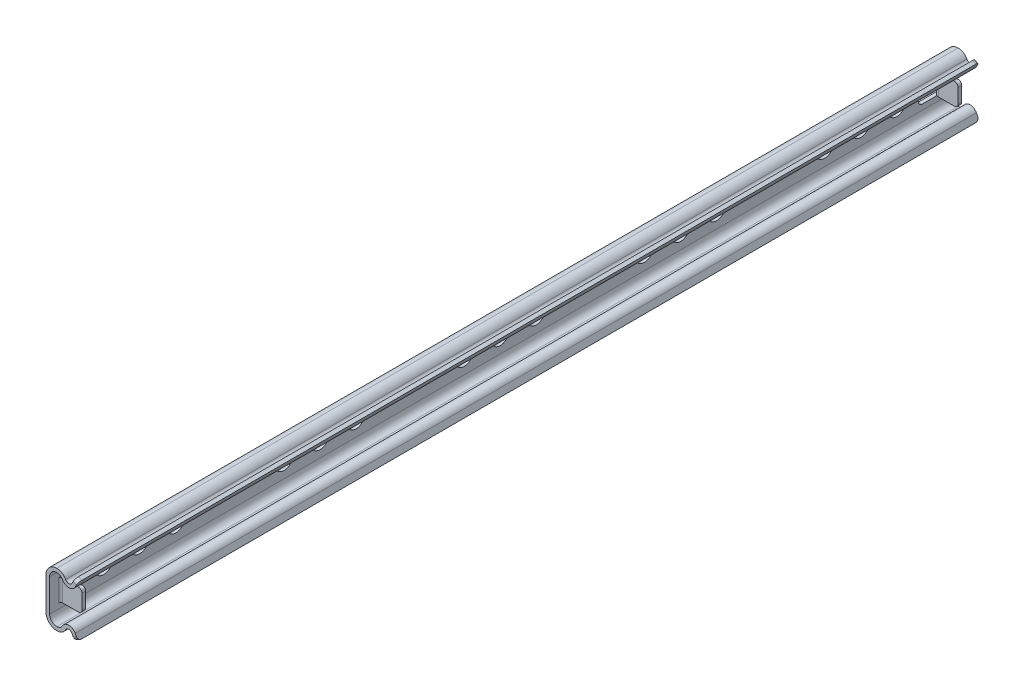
ISO-10303-21;
HEADER;
FILE_DESCRIPTION(('STEP AP214'),'2;1');
FILE_NAME('part.step','',(''),(''),'','','');
FILE_SCHEMA(('AUTOMOTIVE_DESIGN { 1 0 10303 214 1 1 1 1 }'));
ENDSEC;
DATA;
#1=APPLICATION_CONTEXT('core data for automotive mechanical design processes');
#2=APPLICATION_PROTOCOL_DEFINITION('international standard','automotive_design',2000,#1);
#3=PRODUCT_CONTEXT('',#1,'mechanical');
#4=PRODUCT('Part','Part','',(#3));
#5=PRODUCT_RELATED_PRODUCT_CATEGORY('part','',(#4));
#6=PRODUCT_DEFINITION_FORMATION('','',#4);
#7=PRODUCT_DEFINITION_CONTEXT('part definition',#1,'design');
#8=PRODUCT_DEFINITION('design','',#6,#7);
#9=PRODUCT_DEFINITION_SHAPE('','',#8);
#10=(LENGTH_UNIT() NAMED_UNIT(*) SI_UNIT(.MILLI.,.METRE.));
#11=(NAMED_UNIT(*) PLANE_ANGLE_UNIT() SI_UNIT($,.RADIAN.));
#12=(NAMED_UNIT(*) SI_UNIT($,.STERADIAN.) SOLID_ANGLE_UNIT());
#13=UNCERTAINTY_MEASURE_WITH_UNIT(LENGTH_MEASURE(1.E-05),#10,'distance_accuracy_value','');
#14=(GEOMETRIC_REPRESENTATION_CONTEXT(3) GLOBAL_UNCERTAINTY_ASSIGNED_CONTEXT((#13)) GLOBAL_UNIT_ASSIGNED_CONTEXT((#10,
#11,#12)) REPRESENTATION_CONTEXT('',''));
#15=CARTESIAN_POINT('',(0.,0.,0.));
#16=DIRECTION('',(0.,0.,1.));
#17=DIRECTION('',(1.,0.,0.));
#18=AXIS2_PLACEMENT_3D('',#15,#16,#17);
#19=CARTESIAN_POINT('',(-4.,-4.5,125.));
#20=DIRECTION('',(-1.,0.,0.));
#21=DIRECTION('',(0.,-1.,0.));
#22=AXIS2_PLACEMENT_3D('',#19,#20,#21);
#23=PLANE('',#22);
#24=DIRECTION('',(0.,-1.,0.));
#25=VECTOR('',#24,1.);
#26=CARTESIAN_POINT('',(-4.,-4.5,-116.));
#27=LINE('',#26,#25);
#28=CARTESIAN_POINT('',(-4.,2.,-116.));
#29=VERTEX_POINT('',#28);
#30=CARTESIAN_POINT('',(-4.,-2.,-116.));
#31=VERTEX_POINT('',#30);
#32=EDGE_CURVE('E687',#29,#31,#27,.T.);
#33=ORIENTED_EDGE('',*,*,#32,.T.);
#34=CARTESIAN_POINT('',(-4.,-2.,-117.));
#35=DIRECTION('',(-1.,0.,0.));
#36=DIRECTION('',(0.,-1.,0.));
#37=AXIS2_PLACEMENT_3D('',#34,#35,#36);
#38=CIRCLE('',#37,1.);
#39=CARTESIAN_POINT('',(-4.,-3.,-117.));
#40=VERTEX_POINT('',#39);
#41=EDGE_CURVE('E11',#31,#40,#38,.F.);
#42=ORIENTED_EDGE('',*,*,#41,.T.);
#43=DIRECTION('',(0.,0.,-1.));
#44=VECTOR('',#43,1.);
#45=CARTESIAN_POINT('',(-4.,-3.,125.));
#46=LINE('',#45,#44);
#47=CARTESIAN_POINT('',(-4.,-3.,-122.6));
#48=VERTEX_POINT('',#47);
#49=EDGE_CURVE('E686',#40,#48,#46,.T.);
#50=ORIENTED_EDGE('',*,*,#49,.T.);
#51=DIRECTION('',(0.,-1.,0.));
#52=VECTOR('',#51,1.);
#53=CARTESIAN_POINT('',(-4.,-4.5,-122.6));
#54=LINE('',#53,#52);
#55=CARTESIAN_POINT('',(-4.,3.,-122.6));
#56=VERTEX_POINT('',#55);
#57=EDGE_CURVE('E549',#48,#56,#54,.F.);
#58=ORIENTED_EDGE('',*,*,#57,.T.);
#59=DIRECTION('',(0.,0.,1.));
#60=VECTOR('',#59,1.);
#61=CARTESIAN_POINT('',(-4.,3.,125.));
#62=LINE('',#61,#60);
#63=CARTESIAN_POINT('',(-4.,3.,-117.));
#64=VERTEX_POINT('',#63);
#65=EDGE_CURVE('E692',#56,#64,#62,.T.);
#66=ORIENTED_EDGE('',*,*,#65,.T.);
#67=CARTESIAN_POINT('',(-4.,2.,-117.));
#68=DIRECTION('',(-1.,0.,0.));
#69=DIRECTION('',(0.,-1.,0.));
#70=AXIS2_PLACEMENT_3D('',#67,#68,#69);
#71=CIRCLE('',#70,1.);
#72=EDGE_CURVE('E662',#64,#29,#71,.F.);
#73=ORIENTED_EDGE('',*,*,#72,.T.);
#74=EDGE_LOOP('',(#33,#42,#50,#58,#66,#73));
#75=FACE_BOUND('',#74,.T.);
#76=DIRECTION('',(0.,1.,0.));
#77=VECTOR('',#76,1.);
#78=CARTESIAN_POINT('',(-4.,-4.5,-125.));
#79=LINE('',#78,#77);
#80=CARTESIAN_POINT('',(-4.,-4.5,-125.));
#81=VERTEX_POINT('',#80);
#82=CARTESIAN_POINT('',(-4.,4.5,-125.));
#83=VERTEX_POINT('',#82);
#84=EDGE_CURVE('E433',#81,#83,#79,.T.);
#85=ORIENTED_EDGE('',*,*,#84,.F.);
#86=DIRECTION('',(0.,0.,-1.));
#87=VECTOR('',#86,1.);
#88=CARTESIAN_POINT('',(-4.,-4.5,125.));
#89=LINE('',#88,#87);
#90=CARTESIAN_POINT('',(-4.,-4.5,125.));
#91=VERTEX_POINT('',#90);
#92=EDGE_CURVE('E493',#91,#81,#89,.T.);
#93=ORIENTED_EDGE('',*,*,#92,.F.);
#94=DIRECTION('',(0.,1.,0.));
#95=VECTOR('',#94,1.);
#96=CARTESIAN_POINT('',(-4.,-4.5,125.));
#97=LINE('',#96,#95);
#98=CARTESIAN_POINT('',(-4.,4.5,125.));
#99=VERTEX_POINT('',#98);
#100=EDGE_CURVE('E390',#91,#99,#97,.T.);
#101=ORIENTED_EDGE('',*,*,#100,.T.);
#102=DIRECTION('',(0.,0.,-1.));
#103=VECTOR('',#102,1.);
#104=CARTESIAN_POINT('',(-4.,4.5,125.));
#105=LINE('',#104,#103);
#106=EDGE_CURVE('E495',#99,#83,#105,.T.);
#107=ORIENTED_EDGE('',*,*,#106,.T.);
#108=EDGE_LOOP('',(#85,#93,#101,#107));
#109=FACE_BOUND('',#108,.T.);
#110=CARTESIAN_POINT('',(-4.,0.,110.));
#111=DIRECTION('',(-1.,0.,0.));
#112=DIRECTION('',(0.,-1.,0.));
#113=AXIS2_PLACEMENT_3D('',#110,#111,#112);
#114=CIRCLE('',#113,2.50000000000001);
#115=CARTESIAN_POINT('',(-4.,-2.50000000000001,110.));
#116=VERTEX_POINT('',#115);
#117=EDGE_CURVE('E419',#116,#116,#114,.T.);
#118=ORIENTED_EDGE('',*,*,#117,.F.);
#119=EDGE_LOOP('',(#118));
#120=FACE_BOUND('',#119,.T.);
#121=CARTESIAN_POINT('',(-4.,0.,100.));
#122=DIRECTION('',(-1.,0.,0.));
#123=DIRECTION('',(0.,-1.,0.));
#124=AXIS2_PLACEMENT_3D('',#121,#122,#123);
#125=CIRCLE('',#124,2.5);
#126=CARTESIAN_POINT('',(-4.,-2.5,100.));
#127=VERTEX_POINT('',#126);
#128=EDGE_CURVE('E817',#127,#127,#125,.T.);
#129=ORIENTED_EDGE('',*,*,#128,.F.);
#130=EDGE_LOOP('',(#129));
#131=FACE_BOUND('',#130,.T.);
#132=CARTESIAN_POINT('',(-4.,0.,90.));
#133=DIRECTION('',(-1.,0.,0.));
#134=DIRECTION('',(0.,-1.,0.));
#135=AXIS2_PLACEMENT_3D('',#132,#133,#134);
#136=CIRCLE('',#135,2.49999999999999);
#137=CARTESIAN_POINT('',(-4.,-2.49999999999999,90.));
#138=VERTEX_POINT('',#137);
#139=EDGE_CURVE('E811',#138,#138,#136,.T.);
#140=ORIENTED_EDGE('',*,*,#139,.F.);
#141=EDGE_LOOP('',(#140));
#142=FACE_BOUND('',#141,.T.);
#143=CARTESIAN_POINT('',(-4.,0.,60.));
#144=DIRECTION('',(-1.,0.,0.));
#145=DIRECTION('',(0.,-1.,0.));
#146=AXIS2_PLACEMENT_3D('',#143,#144,#145);
#147=CIRCLE('',#146,2.5);
#148=CARTESIAN_POINT('',(-4.,-2.5,60.));
#149=VERTEX_POINT('',#148);
#150=EDGE_CURVE('E805',#149,#149,#147,.T.);
#151=ORIENTED_EDGE('',*,*,#150,.F.);
#152=EDGE_LOOP('',(#151));
#153=FACE_BOUND('',#152,.T.);
#154=CARTESIAN_POINT('',(-4.,0.,50.));
#155=DIRECTION('',(-1.,0.,0.));
#156=DIRECTION('',(0.,-1.,0.));
#157=AXIS2_PLACEMENT_3D('',#154,#155,#156);
#158=CIRCLE('',#157,2.5);
#159=CARTESIAN_POINT('',(-4.,-2.5,50.));
#160=VERTEX_POINT('',#159);
#161=EDGE_CURVE('E799',#160,#160,#158,.T.);
#162=ORIENTED_EDGE('',*,*,#161,.F.);
#163=EDGE_LOOP('',(#162));
#164=FACE_BOUND('',#163,.T.);
#165=CARTESIAN_POINT('',(-4.,0.,40.));
#166=DIRECTION('',(-1.,0.,0.));
#167=DIRECTION('',(0.,-1.,0.));
#168=AXIS2_PLACEMENT_3D('',#165,#166,#167);
#169=CIRCLE('',#168,2.5);
#170=CARTESIAN_POINT('',(-4.,-2.5,40.));
#171=VERTEX_POINT('',#170);
#172=EDGE_CURVE('E793',#171,#171,#169,.T.);
#173=ORIENTED_EDGE('',*,*,#172,.F.);
#174=EDGE_LOOP('',(#173));
#175=FACE_BOUND('',#174,.T.);
#176=CARTESIAN_POINT('',(-4.,0.,10.));
#177=DIRECTION('',(-1.,0.,0.));
#178=DIRECTION('',(0.,-1.,0.));
#179=AXIS2_PLACEMENT_3D('',#176,#177,#178);
#180=CIRCLE('',#179,2.5);
#181=CARTESIAN_POINT('',(-4.,-2.5,10.));
#182=VERTEX_POINT('',#181);
#183=EDGE_CURVE('E787',#182,#182,#180,.T.);
#184=ORIENTED_EDGE('',*,*,#183,.F.);
#185=EDGE_LOOP('',(#184));
#186=FACE_BOUND('',#185,.T.);
#187=CARTESIAN_POINT('',(-4.,0.,0.));
#188=DIRECTION('',(-1.,0.,0.));
#189=DIRECTION('',(0.,-1.,0.));
#190=AXIS2_PLACEMENT_3D('',#187,#188,#189);
#191=CIRCLE('',#190,2.5);
#192=CARTESIAN_POINT('',(-4.,-2.5,0.));
#193=VERTEX_POINT('',#192);
#194=EDGE_CURVE('E781',#193,#193,#191,.T.);
#195=ORIENTED_EDGE('',*,*,#194,.F.);
#196=EDGE_LOOP('',(#195));
#197=FACE_BOUND('',#196,.T.);
#198=CARTESIAN_POINT('',(-4.,0.,-10.));
#199=DIRECTION('',(-1.,0.,0.));
#200=DIRECTION('',(0.,-1.,0.));
#201=AXIS2_PLACEMENT_3D('',#198,#199,#200);
#202=CIRCLE('',#201,2.5);
#203=CARTESIAN_POINT('',(-4.,-2.5,-10.));
#204=VERTEX_POINT('',#203);
#205=EDGE_CURVE('E775',#204,#204,#202,.T.);
#206=ORIENTED_EDGE('',*,*,#205,.F.);
#207=EDGE_LOOP('',(#206));
#208=FACE_BOUND('',#207,.T.);
#209=CARTESIAN_POINT('',(-4.,0.,-40.));
#210=DIRECTION('',(-1.,0.,0.));
#211=DIRECTION('',(0.,-1.,0.));
#212=AXIS2_PLACEMENT_3D('',#209,#210,#211);
#213=CIRCLE('',#212,2.5);
#214=CARTESIAN_POINT('',(-4.,-2.5,-40.));
#215=VERTEX_POINT('',#214);
#216=EDGE_CURVE('E769',#215,#215,#213,.T.);
#217=ORIENTED_EDGE('',*,*,#216,.F.);
#218=EDGE_LOOP('',(#217));
#219=FACE_BOUND('',#218,.T.);
#220=CARTESIAN_POINT('',(-4.,0.,-50.));
#221=DIRECTION('',(-1.,0.,0.));
#222=DIRECTION('',(0.,-1.,0.));
#223=AXIS2_PLACEMENT_3D('',#220,#221,#222);
#224=CIRCLE('',#223,2.5);
#225=CARTESIAN_POINT('',(-4.,-2.5,-50.));
#226=VERTEX_POINT('',#225);
#227=EDGE_CURVE('E763',#226,#226,#224,.T.);
#228=ORIENTED_EDGE('',*,*,#227,.F.);
#229=EDGE_LOOP('',(#228));
#230=FACE_BOUND('',#229,.T.);
#231=CARTESIAN_POINT('',(-4.,0.,-60.));
#232=DIRECTION('',(-1.,0.,0.));
#233=DIRECTION('',(0.,-1.,0.));
#234=AXIS2_PLACEMENT_3D('',#231,#232,#233);
#235=CIRCLE('',#234,2.49999999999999);
#236=CARTESIAN_POINT('',(-4.,-2.49999999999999,-60.));
#237=VERTEX_POINT('',#236);
#238=EDGE_CURVE('E757',#237,#237,#235,.T.);
#239=ORIENTED_EDGE('',*,*,#238,.F.);
#240=EDGE_LOOP('',(#239));
#241=FACE_BOUND('',#240,.T.);
#242=CARTESIAN_POINT('',(-4.,0.,-90.));
#243=DIRECTION('',(-1.,0.,0.));
#244=DIRECTION('',(0.,-1.,0.));
#245=AXIS2_PLACEMENT_3D('',#242,#243,#244);
#246=CIRCLE('',#245,2.50000000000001);
#247=CARTESIAN_POINT('',(-4.,-2.50000000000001,-90.));
#248=VERTEX_POINT('',#247);
#249=EDGE_CURVE('E751',#248,#248,#246,.T.);
#250=ORIENTED_EDGE('',*,*,#249,.F.);
#251=EDGE_LOOP('',(#250));
#252=FACE_BOUND('',#251,.T.);
#253=CARTESIAN_POINT('',(-4.,0.,-100.));
#254=DIRECTION('',(-1.,0.,0.));
#255=DIRECTION('',(0.,-1.,0.));
#256=AXIS2_PLACEMENT_3D('',#253,#254,#255);
#257=CIRCLE('',#256,2.5);
#258=CARTESIAN_POINT('',(-4.,-2.5,-100.));
#259=VERTEX_POINT('',#258);
#260=EDGE_CURVE('E745',#259,#259,#257,.T.);
#261=ORIENTED_EDGE('',*,*,#260,.F.);
#262=EDGE_LOOP('',(#261));
#263=FACE_BOUND('',#262,.T.);
#264=CARTESIAN_POINT('',(-4.,0.,-110.));
#265=DIRECTION('',(-1.,0.,0.));
#266=DIRECTION('',(0.,-1.,0.));
#267=AXIS2_PLACEMENT_3D('',#264,#265,#266);
#268=CIRCLE('',#267,2.49999999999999);
#269=CARTESIAN_POINT('',(-4.,-2.49999999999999,-110.));
#270=VERTEX_POINT('',#269);
#271=EDGE_CURVE('E739',#270,#270,#268,.T.);
#272=ORIENTED_EDGE('',*,*,#271,.F.);
#273=EDGE_LOOP('',(#272));
#274=FACE_BOUND('',#273,.T.);
#275=DIRECTION('',(0.,-1.,0.));
#276=VECTOR('',#275,1.);
#277=CARTESIAN_POINT('',(-4.,-3.,122.6));
#278=LINE('',#277,#276);
#279=CARTESIAN_POINT('',(-4.,3.,122.6));
#280=VERTEX_POINT('',#279);
#281=CARTESIAN_POINT('',(-4.,-3.,122.6));
#282=VERTEX_POINT('',#281);
#283=EDGE_CURVE('E518',#280,#282,#278,.T.);
#284=ORIENTED_EDGE('',*,*,#283,.T.);
#285=DIRECTION('',(0.,0.,1.));
#286=VECTOR('',#285,1.);
#287=CARTESIAN_POINT('',(-4.,-3.,125.));
#288=LINE('',#287,#286);
#289=CARTESIAN_POINT('',(-4.,-3.,117.));
#290=VERTEX_POINT('',#289);
#291=EDGE_CURVE('E731',#290,#282,#288,.T.);
#292=ORIENTED_EDGE('',*,*,#291,.F.);
#293=CARTESIAN_POINT('',(-4.,-2.,117.));
#294=DIRECTION('',(-1.,0.,0.));
#295=DIRECTION('',(0.,-1.,0.));
#296=AXIS2_PLACEMENT_3D('',#293,#294,#295);
#297=CIRCLE('',#296,1.);
#298=CARTESIAN_POINT('',(-4.,-2.,116.));
#299=VERTEX_POINT('',#298);
#300=EDGE_CURVE('E654',#290,#299,#297,.F.);
#301=ORIENTED_EDGE('',*,*,#300,.T.);
#302=DIRECTION('',(0.,-1.,0.));
#303=VECTOR('',#302,1.);
#304=CARTESIAN_POINT('',(-4.,-4.5,116.));
#305=LINE('',#304,#303);
#306=CARTESIAN_POINT('',(-4.,2.,116.));
#307=VERTEX_POINT('',#306);
#308=EDGE_CURVE('E733',#307,#299,#305,.T.);
#309=ORIENTED_EDGE('',*,*,#308,.F.);
#310=CARTESIAN_POINT('',(-4.,2.,117.));
#311=DIRECTION('',(-1.,0.,0.));
#312=DIRECTION('',(0.,-1.,0.));
#313=AXIS2_PLACEMENT_3D('',#310,#311,#312);
#314=CIRCLE('',#313,1.);
#315=CARTESIAN_POINT('',(-4.,3.,117.));
#316=VERTEX_POINT('',#315);
#317=EDGE_CURVE('E658',#307,#316,#314,.F.);
#318=ORIENTED_EDGE('',*,*,#317,.T.);
#319=DIRECTION('',(0.,0.,-1.));
#320=VECTOR('',#319,1.);
#321=CARTESIAN_POINT('',(-4.,3.,125.));
#322=LINE('',#321,#320);
#323=EDGE_CURVE('E728',#280,#316,#322,.T.);
#324=ORIENTED_EDGE('',*,*,#323,.F.);
#325=EDGE_LOOP('',(#284,#292,#301,#309,#318,#324));
#326=FACE_BOUND('',#325,.T.);
#327=ADVANCED_FACE('F30',(#75,#109,#120,#131,#142,#153,#164,#175,#186,#197,#208,#219,#230,#241,
#252,#263,#274,#326),#23,.T.);
#328=CARTESIAN_POINT('',(-3.,-4.5,125.));
#329=DIRECTION('',(-1.,0.,0.));
#330=DIRECTION('',(0.,0.,1.));
#331=AXIS2_PLACEMENT_3D('',#328,#329,#330);
#332=PLANE('',#331);
#333=DIRECTION('',(0.,1.,0.));
#334=VECTOR('',#333,1.);
#335=CARTESIAN_POINT('',(-3.,-4.5,-125.));
#336=LINE('',#335,#334);
#337=CARTESIAN_POINT('',(-3.,-4.5,-125.));
#338=VERTEX_POINT('',#337);
#339=CARTESIAN_POINT('',(-3.,4.5,-125.));
#340=VERTEX_POINT('',#339);
#341=EDGE_CURVE('E456',#338,#340,#336,.T.);
#342=ORIENTED_EDGE('',*,*,#341,.T.);
#343=DIRECTION('',(0.,0.,-1.));
#344=VECTOR('',#343,1.);
#345=CARTESIAN_POINT('',(-3.,4.5,125.));
#346=LINE('',#345,#344);
#347=CARTESIAN_POINT('',(-3.,4.5,125.));
#348=VERTEX_POINT('',#347);
#349=EDGE_CURVE('E466',#348,#340,#346,.T.);
#350=ORIENTED_EDGE('',*,*,#349,.F.);
#351=DIRECTION('',(0.,1.,0.));
#352=VECTOR('',#351,1.);
#353=CARTESIAN_POINT('',(-3.,-4.5,125.));
#354=LINE('',#353,#352);
#355=CARTESIAN_POINT('',(-3.,-4.5,125.));
#356=VERTEX_POINT('',#355);
#357=EDGE_CURVE('E411',#356,#348,#354,.T.);
#358=ORIENTED_EDGE('',*,*,#357,.F.);
#359=DIRECTION('',(0.,0.,-1.));
#360=VECTOR('',#359,1.);
#361=CARTESIAN_POINT('',(-3.,-4.5,125.));
#362=LINE('',#361,#360);
#363=EDGE_CURVE('E469',#356,#338,#362,.T.);
#364=ORIENTED_EDGE('',*,*,#363,.T.);
#365=EDGE_LOOP('',(#342,#350,#358,#364));
#366=FACE_BOUND('',#365,.T.);
#367=CARTESIAN_POINT('',(-3.,0.,110.));
#368=DIRECTION('',(1.,0.,0.));
#369=DIRECTION('',(0.,0.,-1.));
#370=AXIS2_PLACEMENT_3D('',#367,#368,#369);
#371=CIRCLE('',#370,2.50000000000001);
#372=CARTESIAN_POINT('',(-3.,0.,107.5));
#373=VERTEX_POINT('',#372);
#374=EDGE_CURVE('E820',#373,#373,#371,.T.);
#375=ORIENTED_EDGE('',*,*,#374,.F.);
#376=EDGE_LOOP('',(#375));
#377=FACE_BOUND('',#376,.T.);
#378=CARTESIAN_POINT('',(-3.,0.,100.));
#379=DIRECTION('',(1.,0.,0.));
#380=DIRECTION('',(0.,0.,-1.));
#381=AXIS2_PLACEMENT_3D('',#378,#379,#380);
#382=CIRCLE('',#381,2.5);
#383=CARTESIAN_POINT('',(-3.,0.,97.5));
#384=VERTEX_POINT('',#383);
#385=EDGE_CURVE('E814',#384,#384,#382,.T.);
#386=ORIENTED_EDGE('',*,*,#385,.F.);
#387=EDGE_LOOP('',(#386));
#388=FACE_BOUND('',#387,.T.);
#389=CARTESIAN_POINT('',(-3.,0.,90.));
#390=DIRECTION('',(1.,0.,0.));
#391=DIRECTION('',(0.,0.,-1.));
#392=AXIS2_PLACEMENT_3D('',#389,#390,#391);
#393=CIRCLE('',#392,2.49999999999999);
#394=CARTESIAN_POINT('',(-3.,0.,87.5));
#395=VERTEX_POINT('',#394);
#396=EDGE_CURVE('E808',#395,#395,#393,.T.);
#397=ORIENTED_EDGE('',*,*,#396,.F.);
#398=EDGE_LOOP('',(#397));
#399=FACE_BOUND('',#398,.T.);
#400=CARTESIAN_POINT('',(-3.,0.,60.));
#401=DIRECTION('',(1.,0.,0.));
#402=DIRECTION('',(0.,0.,-1.));
#403=AXIS2_PLACEMENT_3D('',#400,#401,#402);
#404=CIRCLE('',#403,2.5);
#405=CARTESIAN_POINT('',(-3.,0.,57.5));
#406=VERTEX_POINT('',#405);
#407=EDGE_CURVE('E802',#406,#406,#404,.T.);
#408=ORIENTED_EDGE('',*,*,#407,.F.);
#409=EDGE_LOOP('',(#408));
#410=FACE_BOUND('',#409,.T.);
#411=CARTESIAN_POINT('',(-3.,0.,50.));
#412=DIRECTION('',(1.,0.,0.));
#413=DIRECTION('',(0.,0.,-1.));
#414=AXIS2_PLACEMENT_3D('',#411,#412,#413);
#415=CIRCLE('',#414,2.5);
#416=CARTESIAN_POINT('',(-3.,0.,47.5));
#417=VERTEX_POINT('',#416);
#418=EDGE_CURVE('E796',#417,#417,#415,.T.);
#419=ORIENTED_EDGE('',*,*,#418,.F.);
#420=EDGE_LOOP('',(#419));
#421=FACE_BOUND('',#420,.T.);
#422=CARTESIAN_POINT('',(-3.,0.,40.));
#423=DIRECTION('',(1.,0.,0.));
#424=DIRECTION('',(0.,0.,-1.));
#425=AXIS2_PLACEMENT_3D('',#422,#423,#424);
#426=CIRCLE('',#425,2.5);
#427=CARTESIAN_POINT('',(-3.,0.,37.5));
#428=VERTEX_POINT('',#427);
#429=EDGE_CURVE('E790',#428,#428,#426,.T.);
#430=ORIENTED_EDGE('',*,*,#429,.F.);
#431=EDGE_LOOP('',(#430));
#432=FACE_BOUND('',#431,.T.);
#433=CARTESIAN_POINT('',(-3.,0.,10.));
#434=DIRECTION('',(1.,0.,0.));
#435=DIRECTION('',(0.,0.,-1.));
#436=AXIS2_PLACEMENT_3D('',#433,#434,#435);
#437=CIRCLE('',#436,2.5);
#438=CARTESIAN_POINT('',(-3.,0.,7.5));
#439=VERTEX_POINT('',#438);
#440=EDGE_CURVE('E784',#439,#439,#437,.T.);
#441=ORIENTED_EDGE('',*,*,#440,.F.);
#442=EDGE_LOOP('',(#441));
#443=FACE_BOUND('',#442,.T.);
#444=CARTESIAN_POINT('',(-3.,0.,0.));
#445=DIRECTION('',(1.,0.,0.));
#446=DIRECTION('',(0.,0.,-1.));
#447=AXIS2_PLACEMENT_3D('',#444,#445,#446);
#448=CIRCLE('',#447,2.5);
#449=CARTESIAN_POINT('',(-3.,0.,-2.5));
#450=VERTEX_POINT('',#449);
#451=EDGE_CURVE('E778',#450,#450,#448,.T.);
#452=ORIENTED_EDGE('',*,*,#451,.F.);
#453=EDGE_LOOP('',(#452));
#454=FACE_BOUND('',#453,.T.);
#455=CARTESIAN_POINT('',(-3.,0.,-10.));
#456=DIRECTION('',(1.,0.,0.));
#457=DIRECTION('',(0.,0.,-1.));
#458=AXIS2_PLACEMENT_3D('',#455,#456,#457);
#459=CIRCLE('',#458,2.5);
#460=CARTESIAN_POINT('',(-3.,0.,-12.5));
#461=VERTEX_POINT('',#460);
#462=EDGE_CURVE('E772',#461,#461,#459,.T.);
#463=ORIENTED_EDGE('',*,*,#462,.F.);
#464=EDGE_LOOP('',(#463));
#465=FACE_BOUND('',#464,.T.);
#466=CARTESIAN_POINT('',(-3.,0.,-40.));
#467=DIRECTION('',(1.,0.,0.));
#468=DIRECTION('',(0.,0.,-1.));
#469=AXIS2_PLACEMENT_3D('',#466,#467,#468);
#470=CIRCLE('',#469,2.5);
#471=CARTESIAN_POINT('',(-3.,0.,-42.5));
#472=VERTEX_POINT('',#471);
#473=EDGE_CURVE('E766',#472,#472,#470,.T.);
#474=ORIENTED_EDGE('',*,*,#473,.F.);
#475=EDGE_LOOP('',(#474));
#476=FACE_BOUND('',#475,.T.);
#477=CARTESIAN_POINT('',(-3.,0.,-50.));
#478=DIRECTION('',(1.,0.,0.));
#479=DIRECTION('',(0.,0.,-1.));
#480=AXIS2_PLACEMENT_3D('',#477,#478,#479);
#481=CIRCLE('',#480,2.5);
#482=CARTESIAN_POINT('',(-3.,0.,-52.5));
#483=VERTEX_POINT('',#482);
#484=EDGE_CURVE('E760',#483,#483,#481,.T.);
#485=ORIENTED_EDGE('',*,*,#484,.F.);
#486=EDGE_LOOP('',(#485));
#487=FACE_BOUND('',#486,.T.);
#488=CARTESIAN_POINT('',(-3.,0.,-60.));
#489=DIRECTION('',(1.,0.,0.));
#490=DIRECTION('',(0.,0.,-1.));
#491=AXIS2_PLACEMENT_3D('',#488,#489,#490);
#492=CIRCLE('',#491,2.49999999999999);
#493=CARTESIAN_POINT('',(-3.,0.,-62.5));
#494=VERTEX_POINT('',#493);
#495=EDGE_CURVE('E754',#494,#494,#492,.T.);
#496=ORIENTED_EDGE('',*,*,#495,.F.);
#497=EDGE_LOOP('',(#496));
#498=FACE_BOUND('',#497,.T.);
#499=CARTESIAN_POINT('',(-3.,0.,-90.));
#500=DIRECTION('',(1.,0.,0.));
#501=DIRECTION('',(0.,0.,-1.));
#502=AXIS2_PLACEMENT_3D('',#499,#500,#501);
#503=CIRCLE('',#502,2.50000000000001);
#504=CARTESIAN_POINT('',(-3.,0.,-92.5));
#505=VERTEX_POINT('',#504);
#506=EDGE_CURVE('E748',#505,#505,#503,.T.);
#507=ORIENTED_EDGE('',*,*,#506,.F.);
#508=EDGE_LOOP('',(#507));
#509=FACE_BOUND('',#508,.T.);
#510=CARTESIAN_POINT('',(-3.,0.,-100.));
#511=DIRECTION('',(1.,0.,0.));
#512=DIRECTION('',(0.,0.,-1.));
#513=AXIS2_PLACEMENT_3D('',#510,#511,#512);
#514=CIRCLE('',#513,2.5);
#515=CARTESIAN_POINT('',(-3.,0.,-102.5));
#516=VERTEX_POINT('',#515);
#517=EDGE_CURVE('E742',#516,#516,#514,.T.);
#518=ORIENTED_EDGE('',*,*,#517,.F.);
#519=EDGE_LOOP('',(#518));
#520=FACE_BOUND('',#519,.T.);
#521=CARTESIAN_POINT('',(-3.,0.,-110.));
#522=DIRECTION('',(1.,0.,0.));
#523=DIRECTION('',(0.,0.,-1.));
#524=AXIS2_PLACEMENT_3D('',#521,#522,#523);
#525=CIRCLE('',#524,2.49999999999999);
#526=CARTESIAN_POINT('',(-3.,0.,-112.5));
#527=VERTEX_POINT('',#526);
#528=EDGE_CURVE('E736',#527,#527,#525,.T.);
#529=ORIENTED_EDGE('',*,*,#528,.F.);
#530=EDGE_LOOP('',(#529));
#531=FACE_BOUND('',#530,.T.);
#532=DIRECTION('',(0.,0.,-1.));
#533=VECTOR('',#532,1.);
#534=CARTESIAN_POINT('',(-3.,-3.,122.));
#535=LINE('',#534,#533);
#536=CARTESIAN_POINT('',(-3.,-3.,122.6));
#537=VERTEX_POINT('',#536);
#538=CARTESIAN_POINT('',(-3.,-3.,121.116760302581));
#539=VERTEX_POINT('',#538);
#540=EDGE_CURVE('E725',#537,#539,#535,.T.);
#541=ORIENTED_EDGE('',*,*,#540,.F.);
#542=DIRECTION('',(0.,-1.,0.));
#543=VECTOR('',#542,1.);
#544=CARTESIAN_POINT('',(-3.,3.,122.6));
#545=LINE('',#544,#543);
#546=CARTESIAN_POINT('',(-3.,3.,122.6));
#547=VERTEX_POINT('',#546);
#548=EDGE_CURVE('E510',#537,#547,#545,.F.);
#549=ORIENTED_EDGE('',*,*,#548,.T.);
#550=DIRECTION('',(0.,0.,1.));
#551=VECTOR('',#550,1.);
#552=CARTESIAN_POINT('',(-3.,3.,122.));
#553=LINE('',#552,#551);
#554=CARTESIAN_POINT('',(-3.,3.,121.116760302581));
#555=VERTEX_POINT('',#554);
#556=EDGE_CURVE('E721',#555,#547,#553,.T.);
#557=ORIENTED_EDGE('',*,*,#556,.F.);
#558=CARTESIAN_POINT('',(-3.,3.,117.));
#559=VERTEX_POINT('',#558);
#560=EDGE_CURVE('E722',#559,#555,#553,.T.);
#561=ORIENTED_EDGE('',*,*,#560,.F.);
#562=CARTESIAN_POINT('',(-3.,2.,117.));
#563=DIRECTION('',(-1.,0.,0.));
#564=DIRECTION('',(0.,0.,1.));
#565=AXIS2_PLACEMENT_3D('',#562,#563,#564);
#566=CIRCLE('',#565,1.);
#567=CARTESIAN_POINT('',(-3.,2.,116.));
#568=VERTEX_POINT('',#567);
#569=EDGE_CURVE('E656',#559,#568,#566,.T.);
#570=ORIENTED_EDGE('',*,*,#569,.T.);
#571=DIRECTION('',(0.,1.,0.));
#572=VECTOR('',#571,1.);
#573=CARTESIAN_POINT('',(-3.,-3.,116.));
#574=LINE('',#573,#572);
#575=CARTESIAN_POINT('',(-3.,-2.,116.));
#576=VERTEX_POINT('',#575);
#577=EDGE_CURVE('E718',#576,#568,#574,.T.);
#578=ORIENTED_EDGE('',*,*,#577,.F.);
#579=CARTESIAN_POINT('',(-3.,-2.,117.));
#580=DIRECTION('',(-1.,0.,0.));
#581=DIRECTION('',(0.,0.,1.));
#582=AXIS2_PLACEMENT_3D('',#579,#580,#581);
#583=CIRCLE('',#582,1.);
#584=CARTESIAN_POINT('',(-3.,-3.,117.));
#585=VERTEX_POINT('',#584);
#586=EDGE_CURVE('E652',#576,#585,#583,.T.);
#587=ORIENTED_EDGE('',*,*,#586,.T.);
#588=EDGE_CURVE('E724',#539,#585,#535,.T.);
#589=ORIENTED_EDGE('',*,*,#588,.F.);
#590=EDGE_LOOP('',(#541,#549,#557,#561,#570,#578,#587,#589));
#591=FACE_BOUND('',#590,.T.);
#592=DIRECTION('',(0.,-1.,0.));
#593=VECTOR('',#592,1.);
#594=CARTESIAN_POINT('',(-3.,-4.5,-122.6));
#595=LINE('',#594,#593);
#596=CARTESIAN_POINT('',(-3.,3.,-122.6));
#597=VERTEX_POINT('',#596);
#598=CARTESIAN_POINT('',(-3.,-3.,-122.6));
#599=VERTEX_POINT('',#598);
#600=EDGE_CURVE('E536',#597,#599,#595,.T.);
#601=ORIENTED_EDGE('',*,*,#600,.T.);
#602=DIRECTION('',(0.,0.,1.));
#603=VECTOR('',#602,1.);
#604=CARTESIAN_POINT('',(-3.,-3.,-122.));
#605=LINE('',#604,#603);
#606=CARTESIAN_POINT('',(-3.,-3.,-121.116760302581));
#607=VERTEX_POINT('',#606);
#608=EDGE_CURVE('E697',#599,#607,#605,.T.);
#609=ORIENTED_EDGE('',*,*,#608,.T.);
#610=CARTESIAN_POINT('',(-3.,-3.,-117.));
#611=VERTEX_POINT('',#610);
#612=EDGE_CURVE('E670',#607,#611,#605,.T.);
#613=ORIENTED_EDGE('',*,*,#612,.T.);
#614=CARTESIAN_POINT('',(-3.,-2.,-117.));
#615=DIRECTION('',(-1.,0.,0.));
#616=DIRECTION('',(0.,0.,1.));
#617=AXIS2_PLACEMENT_3D('',#614,#615,#616);
#618=CIRCLE('',#617,1.);
#619=CARTESIAN_POINT('',(-3.,-2.,-116.));
#620=VERTEX_POINT('',#619);
#621=EDGE_CURVE('E38',#611,#620,#618,.T.);
#622=ORIENTED_EDGE('',*,*,#621,.T.);
#623=DIRECTION('',(0.,1.,0.));
#624=VECTOR('',#623,1.);
#625=CARTESIAN_POINT('',(-3.,-3.,-116.));
#626=LINE('',#625,#624);
#627=CARTESIAN_POINT('',(-3.,2.,-116.));
#628=VERTEX_POINT('',#627);
#629=EDGE_CURVE('E668',#620,#628,#626,.T.);
#630=ORIENTED_EDGE('',*,*,#629,.T.);
#631=CARTESIAN_POINT('',(-3.,2.,-117.));
#632=DIRECTION('',(-1.,0.,0.));
#633=DIRECTION('',(0.,0.,1.));
#634=AXIS2_PLACEMENT_3D('',#631,#632,#633);
#635=CIRCLE('',#634,1.);
#636=CARTESIAN_POINT('',(-3.,3.,-117.));
#637=VERTEX_POINT('',#636);
#638=EDGE_CURVE('E660',#628,#637,#635,.T.);
#639=ORIENTED_EDGE('',*,*,#638,.T.);
#640=DIRECTION('',(0.,0.,-1.));
#641=VECTOR('',#640,1.);
#642=CARTESIAN_POINT('',(-3.,3.,-122.));
#643=LINE('',#642,#641);
#644=CARTESIAN_POINT('',(-3.,3.,-121.116760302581));
#645=VERTEX_POINT('',#644);
#646=EDGE_CURVE('E693',#637,#645,#643,.T.);
#647=ORIENTED_EDGE('',*,*,#646,.T.);
#648=DIRECTION('',(0.,0.,-1.));
#649=VECTOR('',#648,1.);
#650=CARTESIAN_POINT('',(-3.,3.,125.));
#651=LINE('',#650,#649);
#652=EDGE_CURVE('E679',#645,#597,#651,.T.);
#653=ORIENTED_EDGE('',*,*,#652,.T.);
#654=EDGE_LOOP('',(#601,#609,#613,#622,#630,#639,#647,#653));
#655=FACE_BOUND('',#654,.T.);
#656=ADVANCED_FACE('F667',(#366,#377,#388,#399,#410,#421,#432,#443,#454,#465,#476,#487,#498,
#509,#520,#531,#591,#655),#332,.F.);
#657=CARTESIAN_POINT('',(-13.,-3.,122.));
#658=DIRECTION('',(0.,-1.,0.));
#659=DIRECTION('',(0.,0.,-1.));
#660=AXIS2_PLACEMENT_3D('',#657,#658,#659);
#661=PLANE('',#660);
#662=ORIENTED_EDGE('',*,*,#588,.T.);
#663=DIRECTION('',(1.,0.,0.));
#664=VECTOR('',#663,1.);
#665=CARTESIAN_POINT('',(-4.,-3.,117.));
#666=LINE('',#665,#664);
#667=EDGE_CURVE('E569',#585,#290,#666,.F.);
#668=ORIENTED_EDGE('',*,*,#667,.T.);
#669=ORIENTED_EDGE('',*,*,#291,.T.);
#670=CARTESIAN_POINT('',(-2.4,-3.,122.6));
#671=DIRECTION('',(0.,-1.,0.));
#672=DIRECTION('',(0.,0.,-1.));
#673=AXIS2_PLACEMENT_3D('',#670,#671,#672);
#674=CIRCLE('',#673,1.6);
#675=EDGE_CURVE('E530',#282,#539,#674,.T.);
#676=ORIENTED_EDGE('',*,*,#675,.T.);
#677=EDGE_LOOP('',(#662,#668,#669,#676));
#678=FACE_BOUND('',#677,.T.);
#679=ADVANCED_FACE('F871',(#678),#661,.F.);
#680=CARTESIAN_POINT('',(-13.,3.,122.));
#681=DIRECTION('',(0.,1.,0.));
#682=DIRECTION('',(0.,0.,1.));
#683=AXIS2_PLACEMENT_3D('',#680,#681,#682);
#684=PLANE('',#683);
#685=ORIENTED_EDGE('',*,*,#323,.T.);
#686=DIRECTION('',(1.,0.,0.));
#687=VECTOR('',#686,1.);
#688=CARTESIAN_POINT('',(-3.,3.,117.));
#689=LINE('',#688,#687);
#690=EDGE_CURVE('E571',#316,#559,#689,.T.);
#691=ORIENTED_EDGE('',*,*,#690,.T.);
#692=ORIENTED_EDGE('',*,*,#560,.T.);
#693=CARTESIAN_POINT('',(-2.4,3.,122.6));
#694=DIRECTION('',(0.,1.,0.));
#695=DIRECTION('',(0.,0.,1.));
#696=AXIS2_PLACEMENT_3D('',#693,#694,#695);
#697=CIRCLE('',#696,1.6);
#698=EDGE_CURVE('E533',#555,#280,#697,.T.);
#699=ORIENTED_EDGE('',*,*,#698,.T.);
#700=EDGE_LOOP('',(#685,#691,#692,#699));
#701=FACE_BOUND('',#700,.T.);
#702=ADVANCED_FACE('F886',(#701),#684,.F.);
#703=CARTESIAN_POINT('',(2.33333333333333,6.5,125.));
#704=DIRECTION('',(0.,0.,-1.));
#705=DIRECTION('',(-1.,0.,0.));
#706=AXIS2_PLACEMENT_3D('',#703,#704,#705);
#707=CYLINDRICAL_SURFACE('',#706,2.);
#708=CARTESIAN_POINT('',(2.33333333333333,6.5,-125.));
#709=DIRECTION('',(0.,0.,-1.));
#710=DIRECTION('',(-1.,0.,0.));
#711=AXIS2_PLACEMENT_3D('',#708,#709,#710);
#712=CIRCLE('',#711,2.);
#713=CARTESIAN_POINT('',(4.09803921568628,5.55882352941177,-125.));
#714=VERTEX_POINT('',#713);
#715=CARTESIAN_POINT('',(0.568627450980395,5.55882352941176,-125.));
#716=VERTEX_POINT('',#715);
#717=EDGE_CURVE('E365',#714,#716,#712,.T.);
#718=ORIENTED_EDGE('',*,*,#717,.F.);
#719=DIRECTION('',(0.,0.,-1.));
#720=VECTOR('',#719,1.);
#721=CARTESIAN_POINT('',(4.09803921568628,5.55882352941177,125.));
#722=LINE('',#721,#720);
#723=CARTESIAN_POINT('',(4.09803921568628,5.55882352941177,125.));
#724=VERTEX_POINT('',#723);
#725=EDGE_CURVE('E363',#724,#714,#722,.T.);
#726=ORIENTED_EDGE('',*,*,#725,.F.);
#727=CARTESIAN_POINT('',(2.33333333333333,6.5,125.));
#728=DIRECTION('',(0.,0.,1.));
#729=DIRECTION('',(1.,0.,0.));
#730=AXIS2_PLACEMENT_3D('',#727,#728,#729);
#731=CIRCLE('',#730,2.);
#732=CARTESIAN_POINT('',(0.568627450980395,5.55882352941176,125.));
#733=VERTEX_POINT('',#732);
#734=EDGE_CURVE('E349',#733,#724,#731,.T.);
#735=ORIENTED_EDGE('',*,*,#734,.F.);
#736=DIRECTION('',(0.,0.,-1.));
#737=VECTOR('',#736,1.);
#738=CARTESIAN_POINT('',(0.568627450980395,5.55882352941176,125.));
#739=LINE('',#738,#737);
#740=EDGE_CURVE('E416',#733,#716,#739,.T.);
#741=ORIENTED_EDGE('',*,*,#740,.T.);
#742=EDGE_LOOP('',(#718,#726,#735,#741));
#743=FACE_BOUND('',#742,.T.);
#744=ADVANCED_FACE('F364',(#743),#707,.T.);
#745=CARTESIAN_POINT('',(4.09803921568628,5.55882352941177,125.));
#746=DIRECTION('',(-0.882352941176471,0.470588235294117,0.));
#747=DIRECTION('',(-0.470588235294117,-0.882352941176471,0.));
#748=AXIS2_PLACEMENT_3D('',#745,#746,#747);
#749=PLANE('',#748);
#750=DIRECTION('',(0.470588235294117,0.882352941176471,0.));
#751=VECTOR('',#750,1.);
#752=CARTESIAN_POINT('',(4.09803921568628,5.55882352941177,-125.));
#753=LINE('',#752,#751);
#754=CARTESIAN_POINT('',(4.41176470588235,6.14705882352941,-125.));
#755=VERTEX_POINT('',#754);
#756=EDGE_CURVE('E418',#714,#755,#753,.T.);
#757=ORIENTED_EDGE('',*,*,#756,.T.);
#758=CARTESIAN_POINT('',(4.41176470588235,6.14705882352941,-124.));
#759=DIRECTION('',(-0.882352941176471,0.470588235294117,0.));
#760=DIRECTION('',(-0.470588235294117,-0.882352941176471,0.));
#761=AXIS2_PLACEMENT_3D('',#758,#759,#760);
#762=CIRCLE('',#761,1.);
#763=CARTESIAN_POINT('',(4.88235294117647,7.02941176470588,-124.));
#764=VERTEX_POINT('',#763);
#765=EDGE_CURVE('E626',#755,#764,#762,.F.);
#766=ORIENTED_EDGE('',*,*,#765,.T.);
#767=DIRECTION('',(0.,0.,-1.));
#768=VECTOR('',#767,1.);
#769=CARTESIAN_POINT('',(4.88235294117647,7.02941176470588,125.));
#770=LINE('',#769,#768);
#771=CARTESIAN_POINT('',(4.88235294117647,7.02941176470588,124.));
#772=VERTEX_POINT('',#771);
#773=EDGE_CURVE('E370',#772,#764,#770,.T.);
#774=ORIENTED_EDGE('',*,*,#773,.F.);
#775=CARTESIAN_POINT('',(4.41176470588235,6.14705882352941,124.));
#776=DIRECTION('',(-0.882352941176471,0.470588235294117,0.));
#777=DIRECTION('',(-0.470588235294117,-0.882352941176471,0.));
#778=AXIS2_PLACEMENT_3D('',#775,#776,#777);
#779=CIRCLE('',#778,1.);
#780=CARTESIAN_POINT('',(4.41176470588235,6.14705882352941,125.));
#781=VERTEX_POINT('',#780);
#782=EDGE_CURVE('E374',#772,#781,#779,.F.);
#783=ORIENTED_EDGE('',*,*,#782,.T.);
#784=DIRECTION('',(0.470588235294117,0.882352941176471,0.));
#785=VECTOR('',#784,1.);
#786=CARTESIAN_POINT('',(4.09803921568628,5.55882352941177,125.));
#787=LINE('',#786,#785);
#788=EDGE_CURVE('E353',#724,#781,#787,.T.);
#789=ORIENTED_EDGE('',*,*,#788,.F.);
#790=ORIENTED_EDGE('',*,*,#725,.T.);
#791=EDGE_LOOP('',(#757,#766,#774,#783,#789,#790));
#792=FACE_BOUND('',#791,.T.);
#793=ADVANCED_FACE('F372',(#792),#749,.F.);
#794=CARTESIAN_POINT('',(4.,7.5,125.));
#795=DIRECTION('',(0.470588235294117,0.882352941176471,0.));
#796=DIRECTION('',(-0.882352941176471,0.470588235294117,0.));
#797=AXIS2_PLACEMENT_3D('',#794,#795,#796);
#798=PLANE('',#797);
#799=ORIENTED_EDGE('',*,*,#773,.T.);
#800=DIRECTION('',(0.882352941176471,-0.470588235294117,0.));
#801=VECTOR('',#800,1.);
#802=CARTESIAN_POINT('',(4.,7.5,-124.));
#803=LINE('',#802,#801);
#804=CARTESIAN_POINT('',(4.,7.5,-124.));
#805=VERTEX_POINT('',#804);
#806=EDGE_CURVE('E631',#764,#805,#803,.F.);
#807=ORIENTED_EDGE('',*,*,#806,.T.);
#808=DIRECTION('',(0.,0.,-1.));
#809=VECTOR('',#808,1.);
#810=CARTESIAN_POINT('',(4.,7.5,125.));
#811=LINE('',#810,#809);
#812=CARTESIAN_POINT('',(4.,7.5,124.));
#813=VERTEX_POINT('',#812);
#814=EDGE_CURVE('E503',#813,#805,#811,.T.);
#815=ORIENTED_EDGE('',*,*,#814,.F.);
#816=DIRECTION('',(0.882352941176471,-0.470588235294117,0.));
#817=VECTOR('',#816,1.);
#818=CARTESIAN_POINT('',(4.,7.5,124.));
#819=LINE('',#818,#817);
#820=EDGE_CURVE('E628',#813,#772,#819,.T.);
#821=ORIENTED_EDGE('',*,*,#820,.T.);
#822=EDGE_LOOP('',(#799,#807,#815,#821));
#823=FACE_BOUND('',#822,.T.);
#824=ADVANCED_FACE('F964',(#823),#798,.T.);
#825=CARTESIAN_POINT('',(3.2156862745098,6.02941176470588,125.));
#826=DIRECTION('',(-0.88235294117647,0.470588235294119,0.));
#827=DIRECTION('',(-0.470588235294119,-0.88235294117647,0.));
#828=AXIS2_PLACEMENT_3D('',#825,#826,#827);
#829=PLANE('',#828);
#830=ORIENTED_EDGE('',*,*,#814,.T.);
#831=CARTESIAN_POINT('',(3.52941176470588,6.61764705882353,-124.));
#832=DIRECTION('',(-0.88235294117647,0.470588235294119,0.));
#833=DIRECTION('',(-0.470588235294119,-0.88235294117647,0.));
#834=AXIS2_PLACEMENT_3D('',#831,#832,#833);
#835=CIRCLE('',#834,1.);
#836=CARTESIAN_POINT('',(3.52941176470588,6.61764705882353,-125.));
#837=VERTEX_POINT('',#836);
#838=EDGE_CURVE('E635',#805,#837,#835,.T.);
#839=ORIENTED_EDGE('',*,*,#838,.T.);
#840=DIRECTION('',(0.470588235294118,0.88235294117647,0.));
#841=VECTOR('',#840,1.);
#842=CARTESIAN_POINT('',(3.2156862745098,6.02941176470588,-125.));
#843=LINE('',#842,#841);
#844=CARTESIAN_POINT('',(3.2156862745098,6.02941176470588,-125.));
#845=VERTEX_POINT('',#844);
#846=EDGE_CURVE('E421',#845,#837,#843,.T.);
#847=ORIENTED_EDGE('',*,*,#846,.F.);
#848=DIRECTION('',(0.,0.,-1.));
#849=VECTOR('',#848,1.);
#850=CARTESIAN_POINT('',(3.2156862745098,6.02941176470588,125.));
#851=LINE('',#850,#849);
#852=CARTESIAN_POINT('',(3.2156862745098,6.02941176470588,125.));
#853=VERTEX_POINT('',#852);
#854=EDGE_CURVE('E501',#853,#845,#851,.T.);
#855=ORIENTED_EDGE('',*,*,#854,.F.);
#856=DIRECTION('',(0.470588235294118,0.88235294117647,0.));
#857=VECTOR('',#856,1.);
#858=CARTESIAN_POINT('',(3.2156862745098,6.02941176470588,125.));
#859=LINE('',#858,#857);
#860=CARTESIAN_POINT('',(3.52941176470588,6.61764705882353,125.));
#861=VERTEX_POINT('',#860);
#862=EDGE_CURVE('E375',#853,#861,#859,.T.);
#863=ORIENTED_EDGE('',*,*,#862,.T.);
#864=CARTESIAN_POINT('',(3.52941176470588,6.61764705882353,124.));
#865=DIRECTION('',(-0.88235294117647,0.470588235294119,0.));
#866=DIRECTION('',(-0.470588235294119,-0.88235294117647,0.));
#867=AXIS2_PLACEMENT_3D('',#864,#865,#866);
#868=CIRCLE('',#867,1.);
#869=EDGE_CURVE('E633',#861,#813,#868,.T.);
#870=ORIENTED_EDGE('',*,*,#869,.T.);
#871=EDGE_LOOP('',(#830,#839,#847,#855,#863,#870));
#872=FACE_BOUND('',#871,.T.);
#873=ADVANCED_FACE('F960',(#872),#829,.T.);
#874=CARTESIAN_POINT('',(2.33333333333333,6.5,125.));
#875=DIRECTION('',(0.,0.,-1.));
#876=DIRECTION('',(-1.,0.,0.));
#877=AXIS2_PLACEMENT_3D('',#874,#875,#876);
#878=CYLINDRICAL_SURFACE('',#877,1.);
#879=CARTESIAN_POINT('',(2.33333333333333,6.5,-125.));
#880=DIRECTION('',(0.,0.,1.));
#881=DIRECTION('',(1.,0.,0.));
#882=AXIS2_PLACEMENT_3D('',#879,#880,#881);
#883=CIRCLE('',#882,1.);
#884=CARTESIAN_POINT('',(1.45098039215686,6.02941176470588,-125.));
#885=VERTEX_POINT('',#884);
#886=EDGE_CURVE('E424',#885,#845,#883,.T.);
#887=ORIENTED_EDGE('',*,*,#886,.F.);
#888=DIRECTION('',(0.,0.,-1.));
#889=VECTOR('',#888,1.);
#890=CARTESIAN_POINT('',(1.45098039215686,6.02941176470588,125.));
#891=LINE('',#890,#889);
#892=CARTESIAN_POINT('',(1.45098039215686,6.02941176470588,125.));
#893=VERTEX_POINT('',#892);
#894=EDGE_CURVE('E499',#893,#885,#891,.T.);
#895=ORIENTED_EDGE('',*,*,#894,.F.);
#896=CARTESIAN_POINT('',(2.33333333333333,6.5,125.));
#897=DIRECTION('',(0.,0.,1.));
#898=DIRECTION('',(1.,0.,0.));
#899=AXIS2_PLACEMENT_3D('',#896,#897,#898);
#900=CIRCLE('',#899,1.);
#901=EDGE_CURVE('E378',#893,#853,#900,.T.);
#902=ORIENTED_EDGE('',*,*,#901,.T.);
#903=ORIENTED_EDGE('',*,*,#854,.T.);
#904=EDGE_LOOP('',(#887,#895,#902,#903));
#905=FACE_BOUND('',#904,.T.);
#906=ADVANCED_FACE('F973',(#905),#878,.F.);
#907=CARTESIAN_POINT('',(-1.,4.72222222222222,125.));
#908=DIRECTION('',(0.,0.,-1.));
#909=DIRECTION('',(-1.,0.,0.));
#910=AXIS2_PLACEMENT_3D('',#907,#908,#909);
#911=CYLINDRICAL_SURFACE('',#910,2.77777777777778);
#912=CARTESIAN_POINT('',(-1.,4.72222222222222,-125.));
#913=DIRECTION('',(0.,0.,-1.));
#914=DIRECTION('',(-1.,0.,0.));
#915=AXIS2_PLACEMENT_3D('',#912,#913,#914);
#916=CIRCLE('',#915,2.77777777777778);
#917=CARTESIAN_POINT('',(-1.,7.5,-125.));
#918=VERTEX_POINT('',#917);
#919=EDGE_CURVE('E427',#918,#885,#916,.T.);
#920=ORIENTED_EDGE('',*,*,#919,.F.);
#921=DIRECTION('',(0.,0.,-1.));
#922=VECTOR('',#921,1.);
#923=CARTESIAN_POINT('',(-1.,7.5,125.));
#924=LINE('',#923,#922);
#925=CARTESIAN_POINT('',(-1.,7.5,125.));
#926=VERTEX_POINT('',#925);
#927=EDGE_CURVE('E497',#926,#918,#924,.T.);
#928=ORIENTED_EDGE('',*,*,#927,.F.);
#929=CARTESIAN_POINT('',(-1.,4.72222222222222,125.));
#930=DIRECTION('',(0.,0.,-1.));
#931=DIRECTION('',(-1.,0.,0.));
#932=AXIS2_PLACEMENT_3D('',#929,#930,#931);
#933=CIRCLE('',#932,2.77777777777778);
#934=EDGE_CURVE('E384',#926,#893,#933,.T.);
#935=ORIENTED_EDGE('',*,*,#934,.T.);
#936=ORIENTED_EDGE('',*,*,#894,.T.);
#937=EDGE_LOOP('',(#920,#928,#935,#936));
#938=FACE_BOUND('',#937,.T.);
#939=ADVANCED_FACE('F978',(#938),#911,.T.);
#940=CARTESIAN_POINT('',(-0.999999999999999,4.5,125.));
#941=DIRECTION('',(0.,0.,-1.));
#942=DIRECTION('',(-1.,0.,0.));
#943=AXIS2_PLACEMENT_3D('',#940,#941,#942);
#944=CYLINDRICAL_SURFACE('',#943,3.);
#945=CARTESIAN_POINT('',(-0.999999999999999,4.5,-125.));
#946=DIRECTION('',(0.,0.,-1.));
#947=DIRECTION('',(-1.,0.,0.));
#948=AXIS2_PLACEMENT_3D('',#945,#946,#947);
#949=CIRCLE('',#948,3.);
#950=EDGE_CURVE('E430',#83,#918,#949,.T.);
#951=ORIENTED_EDGE('',*,*,#950,.F.);
#952=ORIENTED_EDGE('',*,*,#106,.F.);
#953=CARTESIAN_POINT('',(-0.999999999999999,4.5,125.));
#954=DIRECTION('',(0.,0.,-1.));
#955=DIRECTION('',(-1.,0.,0.));
#956=AXIS2_PLACEMENT_3D('',#953,#954,#955);
#957=CIRCLE('',#956,3.);
#958=EDGE_CURVE('E387',#99,#926,#957,.T.);
#959=ORIENTED_EDGE('',*,*,#958,.T.);
#960=ORIENTED_EDGE('',*,*,#927,.T.);
#961=EDGE_LOOP('',(#951,#952,#959,#960));
#962=FACE_BOUND('',#961,.T.);
#963=ADVANCED_FACE('F981',(#962),#944,.T.);
#964=CARTESIAN_POINT('',(-0.999999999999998,-4.5,125.));
#965=DIRECTION('',(0.,0.,-1.));
#966=DIRECTION('',(-1.,0.,0.));
#967=AXIS2_PLACEMENT_3D('',#964,#965,#966);
#968=CYLINDRICAL_SURFACE('',#967,3.);
#969=CARTESIAN_POINT('',(-0.999999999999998,-4.5,-125.));
#970=DIRECTION('',(0.,0.,-1.));
#971=DIRECTION('',(-1.,0.,0.));
#972=AXIS2_PLACEMENT_3D('',#969,#970,#971);
#973=CIRCLE('',#972,3.);
#974=CARTESIAN_POINT('',(-1.,-7.5,-125.));
#975=VERTEX_POINT('',#974);
#976=EDGE_CURVE('E436',#975,#81,#973,.T.);
#977=ORIENTED_EDGE('',*,*,#976,.F.);
#978=DIRECTION('',(0.,0.,-1.));
#979=VECTOR('',#978,1.);
#980=CARTESIAN_POINT('',(-1.,-7.5,125.));
#981=LINE('',#980,#979);
#982=CARTESIAN_POINT('',(-1.,-7.5,125.));
#983=VERTEX_POINT('',#982);
#984=EDGE_CURVE('E491',#983,#975,#981,.T.);
#985=ORIENTED_EDGE('',*,*,#984,.F.);
#986=CARTESIAN_POINT('',(-0.999999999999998,-4.5,125.));
#987=DIRECTION('',(0.,0.,-1.));
#988=DIRECTION('',(-1.,0.,0.));
#989=AXIS2_PLACEMENT_3D('',#986,#987,#988);
#990=CIRCLE('',#989,3.);
#991=EDGE_CURVE('E393',#983,#91,#990,.T.);
#992=ORIENTED_EDGE('',*,*,#991,.T.);
#993=ORIENTED_EDGE('',*,*,#92,.T.);
#994=EDGE_LOOP('',(#977,#985,#992,#993));
#995=FACE_BOUND('',#994,.T.);
#996=ADVANCED_FACE('F987',(#995),#968,.T.);
#997=CARTESIAN_POINT('',(-1.,-4.72222222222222,125.));
#998=DIRECTION('',(0.,0.,-1.));
#999=DIRECTION('',(-1.,0.,0.));
#1000=AXIS2_PLACEMENT_3D('',#997,#998,#999);
#1001=CYLINDRICAL_SURFACE('',#1000,2.77777777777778);
#1002=CARTESIAN_POINT('',(-1.,-4.72222222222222,-125.));
#1003=DIRECTION('',(0.,0.,1.));
#1004=DIRECTION('',(1.,0.,0.));
#1005=AXIS2_PLACEMENT_3D('',#1002,#1003,#1004);
#1006=CIRCLE('',#1005,2.77777777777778);
#1007=CARTESIAN_POINT('',(1.45098039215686,-6.02941176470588,-125.));
#1008=VERTEX_POINT('',#1007);
#1009=EDGE_CURVE('E439',#975,#1008,#1006,.T.);
#1010=ORIENTED_EDGE('',*,*,#1009,.T.);
#1011=DIRECTION('',(0.,0.,-1.));
#1012=VECTOR('',#1011,1.);
#1013=CARTESIAN_POINT('',(1.45098039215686,-6.02941176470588,125.));
#1014=LINE('',#1013,#1012);
#1015=CARTESIAN_POINT('',(1.45098039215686,-6.02941176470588,125.));
#1016=VERTEX_POINT('',#1015);
#1017=EDGE_CURVE('E488',#1016,#1008,#1014,.T.);
#1018=ORIENTED_EDGE('',*,*,#1017,.F.);
#1019=CARTESIAN_POINT('',(-1.,-4.72222222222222,125.));
#1020=DIRECTION('',(0.,0.,1.));
#1021=DIRECTION('',(1.,0.,0.));
#1022=AXIS2_PLACEMENT_3D('',#1019,#1020,#1021);
#1023=CIRCLE('',#1022,2.77777777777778);
#1024=EDGE_CURVE('E396',#983,#1016,#1023,.T.);
#1025=ORIENTED_EDGE('',*,*,#1024,.F.);
#1026=ORIENTED_EDGE('',*,*,#984,.T.);
#1027=EDGE_LOOP('',(#1010,#1018,#1025,#1026));
#1028=FACE_BOUND('',#1027,.T.);
#1029=ADVANCED_FACE('F993',(#1028),#1001,.T.);
#1030=CARTESIAN_POINT('',(2.33333333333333,-6.5,125.));
#1031=DIRECTION('',(0.,0.,-1.));
#1032=DIRECTION('',(-1.,0.,0.));
#1033=AXIS2_PLACEMENT_3D('',#1030,#1031,#1032);
#1034=CYLINDRICAL_SURFACE('',#1033,1.);
#1035=CARTESIAN_POINT('',(2.33333333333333,-6.5,-125.));
#1036=DIRECTION('',(0.,0.,-1.));
#1037=DIRECTION('',(-1.,0.,0.));
#1038=AXIS2_PLACEMENT_3D('',#1035,#1036,#1037);
#1039=CIRCLE('',#1038,1.);
#1040=CARTESIAN_POINT('',(3.21568627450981,-6.02941176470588,-125.));
#1041=VERTEX_POINT('',#1040);
#1042=EDGE_CURVE('E441',#1008,#1041,#1039,.T.);
#1043=ORIENTED_EDGE('',*,*,#1042,.T.);
#1044=DIRECTION('',(0.,0.,-1.));
#1045=VECTOR('',#1044,1.);
#1046=CARTESIAN_POINT('',(3.21568627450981,-6.02941176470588,125.));
#1047=LINE('',#1046,#1045);
#1048=CARTESIAN_POINT('',(3.21568627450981,-6.02941176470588,125.));
#1049=VERTEX_POINT('',#1048);
#1050=EDGE_CURVE('E485',#1049,#1041,#1047,.T.);
#1051=ORIENTED_EDGE('',*,*,#1050,.F.);
#1052=CARTESIAN_POINT('',(2.33333333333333,-6.5,125.));
#1053=DIRECTION('',(0.,0.,-1.));
#1054=DIRECTION('',(-1.,0.,0.));
#1055=AXIS2_PLACEMENT_3D('',#1052,#1053,#1054);
#1056=CIRCLE('',#1055,1.);
#1057=EDGE_CURVE('E398',#1016,#1049,#1056,.T.);
#1058=ORIENTED_EDGE('',*,*,#1057,.F.);
#1059=ORIENTED_EDGE('',*,*,#1017,.T.);
#1060=EDGE_LOOP('',(#1043,#1051,#1058,#1059));
#1061=FACE_BOUND('',#1060,.T.);
#1062=ADVANCED_FACE('F997',(#1061),#1034,.F.);
#1063=CARTESIAN_POINT('',(3.21568627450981,-6.02941176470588,125.));
#1064=DIRECTION('',(0.882352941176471,0.470588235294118,0.));
#1065=DIRECTION('',(-0.470588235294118,0.882352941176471,0.));
#1066=AXIS2_PLACEMENT_3D('',#1063,#1064,#1065);
#1067=PLANE('',#1066);
#1068=DIRECTION('',(0.470588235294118,-0.88235294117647,0.));
#1069=VECTOR('',#1068,1.);
#1070=CARTESIAN_POINT('',(3.21568627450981,-6.02941176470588,-125.));
#1071=LINE('',#1070,#1069);
#1072=CARTESIAN_POINT('',(3.52941176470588,-6.61764705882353,-125.));
#1073=VERTEX_POINT('',#1072);
#1074=EDGE_CURVE('E443',#1041,#1073,#1071,.T.);
#1075=ORIENTED_EDGE('',*,*,#1074,.T.);
#1076=CARTESIAN_POINT('',(3.52941176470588,-6.61764705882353,-124.));
#1077=DIRECTION('',(0.882352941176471,0.470588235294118,0.));
#1078=DIRECTION('',(-0.470588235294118,0.882352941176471,0.));
#1079=AXIS2_PLACEMENT_3D('',#1076,#1077,#1078);
#1080=CIRCLE('',#1079,1.);
#1081=CARTESIAN_POINT('',(4.,-7.5,-124.));
#1082=VERTEX_POINT('',#1081);
#1083=EDGE_CURVE('E646',#1073,#1082,#1080,.F.);
#1084=ORIENTED_EDGE('',*,*,#1083,.T.);
#1085=DIRECTION('',(0.,0.,-1.));
#1086=VECTOR('',#1085,1.);
#1087=CARTESIAN_POINT('',(4.,-7.5,125.));
#1088=LINE('',#1087,#1086);
#1089=CARTESIAN_POINT('',(4.,-7.5,124.));
#1090=VERTEX_POINT('',#1089);
#1091=EDGE_CURVE('E482',#1090,#1082,#1088,.T.);
#1092=ORIENTED_EDGE('',*,*,#1091,.F.);
#1093=CARTESIAN_POINT('',(3.52941176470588,-6.61764705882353,124.));
#1094=DIRECTION('',(0.882352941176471,0.470588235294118,0.));
#1095=DIRECTION('',(-0.470588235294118,0.882352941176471,0.));
#1096=AXIS2_PLACEMENT_3D('',#1093,#1094,#1095);
#1097=CIRCLE('',#1096,1.);
#1098=CARTESIAN_POINT('',(3.52941176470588,-6.61764705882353,125.));
#1099=VERTEX_POINT('',#1098);
#1100=EDGE_CURVE('E45',#1090,#1099,#1097,.F.);
#1101=ORIENTED_EDGE('',*,*,#1100,.T.);
#1102=DIRECTION('',(0.470588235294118,-0.88235294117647,0.));
#1103=VECTOR('',#1102,1.);
#1104=CARTESIAN_POINT('',(3.21568627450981,-6.02941176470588,125.));
#1105=LINE('',#1104,#1103);
#1106=EDGE_CURVE('E400',#1049,#1099,#1105,.T.);
#1107=ORIENTED_EDGE('',*,*,#1106,.F.);
#1108=ORIENTED_EDGE('',*,*,#1050,.T.);
#1109=EDGE_LOOP('',(#1075,#1084,#1092,#1101,#1107,#1108));
#1110=FACE_BOUND('',#1109,.T.);
#1111=ADVANCED_FACE('F999',(#1110),#1067,.F.);
#1112=CARTESIAN_POINT('',(4.,-7.5,125.));
#1113=DIRECTION('',(-0.470588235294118,0.882352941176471,0.));
#1114=DIRECTION('',(-0.882352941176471,-0.470588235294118,0.));
#1115=AXIS2_PLACEMENT_3D('',#1112,#1113,#1114);
#1116=PLANE('',#1115);
#1117=ORIENTED_EDGE('',*,*,#1091,.T.);
#1118=DIRECTION('',(0.882352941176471,0.470588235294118,0.));
#1119=VECTOR('',#1118,1.);
#1120=CARTESIAN_POINT('',(4.,-7.5,-124.));
#1121=LINE('',#1120,#1119);
#1122=CARTESIAN_POINT('',(4.88235294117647,-7.02941176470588,-124.));
#1123=VERTEX_POINT('',#1122);
#1124=EDGE_CURVE('E639',#1082,#1123,#1121,.T.);
#1125=ORIENTED_EDGE('',*,*,#1124,.T.);
#1126=DIRECTION('',(0.,0.,-1.));
#1127=VECTOR('',#1126,1.);
#1128=CARTESIAN_POINT('',(4.88235294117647,-7.02941176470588,125.));
#1129=LINE('',#1128,#1127);
#1130=CARTESIAN_POINT('',(4.88235294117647,-7.02941176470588,124.));
#1131=VERTEX_POINT('',#1130);
#1132=EDGE_CURVE('E479',#1131,#1123,#1129,.T.);
#1133=ORIENTED_EDGE('',*,*,#1132,.F.);
#1134=DIRECTION('',(0.882352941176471,0.470588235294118,0.));
#1135=VECTOR('',#1134,1.);
#1136=CARTESIAN_POINT('',(4.,-7.5,124.));
#1137=LINE('',#1136,#1135);
#1138=EDGE_CURVE('E637',#1131,#1090,#1137,.F.);
#1139=ORIENTED_EDGE('',*,*,#1138,.T.);
#1140=EDGE_LOOP('',(#1117,#1125,#1133,#1139));
#1141=FACE_BOUND('',#1140,.T.);
#1142=ADVANCED_FACE('F1003',(#1141),#1116,.F.);
#1143=CARTESIAN_POINT('',(4.88235294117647,-7.02941176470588,125.));
#1144=DIRECTION('',(-0.882352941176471,-0.470588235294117,0.));
#1145=DIRECTION('',(0.470588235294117,-0.882352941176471,0.));
#1146=AXIS2_PLACEMENT_3D('',#1143,#1144,#1145);
#1147=PLANE('',#1146);
#1148=ORIENTED_EDGE('',*,*,#1132,.T.);
#1149=CARTESIAN_POINT('',(4.41176470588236,-6.14705882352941,-124.));
#1150=DIRECTION('',(-0.882352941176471,-0.470588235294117,0.));
#1151=DIRECTION('',(0.470588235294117,-0.882352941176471,0.));
#1152=AXIS2_PLACEMENT_3D('',#1149,#1150,#1151);
#1153=CIRCLE('',#1152,1.);
#1154=CARTESIAN_POINT('',(4.41176470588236,-6.14705882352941,-125.));
#1155=VERTEX_POINT('',#1154);
#1156=EDGE_CURVE('E643',#1123,#1155,#1153,.F.);
#1157=ORIENTED_EDGE('',*,*,#1156,.T.);
#1158=DIRECTION('',(-0.470588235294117,0.882352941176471,0.));
#1159=VECTOR('',#1158,1.);
#1160=CARTESIAN_POINT('',(4.88235294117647,-7.02941176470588,-125.));
#1161=LINE('',#1160,#1159);
#1162=CARTESIAN_POINT('',(4.09803921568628,-5.55882352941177,-125.));
#1163=VERTEX_POINT('',#1162);
#1164=EDGE_CURVE('E446',#1155,#1163,#1161,.T.);
#1165=ORIENTED_EDGE('',*,*,#1164,.T.);
#1166=DIRECTION('',(0.,0.,-1.));
#1167=VECTOR('',#1166,1.);
#1168=CARTESIAN_POINT('',(4.09803921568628,-5.55882352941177,125.));
#1169=LINE('',#1168,#1167);
#1170=CARTESIAN_POINT('',(4.09803921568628,-5.55882352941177,125.));
#1171=VERTEX_POINT('',#1170);
#1172=EDGE_CURVE('E476',#1171,#1163,#1169,.T.);
#1173=ORIENTED_EDGE('',*,*,#1172,.F.);
#1174=DIRECTION('',(-0.470588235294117,0.882352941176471,0.));
#1175=VECTOR('',#1174,1.);
#1176=CARTESIAN_POINT('',(4.88235294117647,-7.02941176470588,125.));
#1177=LINE('',#1176,#1175);
#1178=CARTESIAN_POINT('',(4.41176470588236,-6.14705882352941,125.));
#1179=VERTEX_POINT('',#1178);
#1180=EDGE_CURVE('E402',#1179,#1171,#1177,.T.);
#1181=ORIENTED_EDGE('',*,*,#1180,.F.);
#1182=CARTESIAN_POINT('',(4.41176470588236,-6.14705882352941,124.));
#1183=DIRECTION('',(-0.882352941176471,-0.470588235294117,0.));
#1184=DIRECTION('',(0.470588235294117,-0.882352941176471,0.));
#1185=AXIS2_PLACEMENT_3D('',#1182,#1183,#1184);
#1186=CIRCLE('',#1185,1.);
#1187=EDGE_CURVE('E53',#1179,#1131,#1186,.F.);
#1188=ORIENTED_EDGE('',*,*,#1187,.T.);
#1189=EDGE_LOOP('',(#1148,#1157,#1165,#1173,#1181,#1188));
#1190=FACE_BOUND('',#1189,.T.);
#1191=ADVANCED_FACE('F1008',(#1190),#1147,.F.);
#1192=CARTESIAN_POINT('',(2.33333333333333,-6.5,125.));
#1193=DIRECTION('',(0.,0.,-1.));
#1194=DIRECTION('',(-1.,0.,0.));
#1195=AXIS2_PLACEMENT_3D('',#1192,#1193,#1194);
#1196=CYLINDRICAL_SURFACE('',#1195,2.);
#1197=CARTESIAN_POINT('',(2.33333333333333,-6.5,-125.));
#1198=DIRECTION('',(0.,0.,-1.));
#1199=DIRECTION('',(-1.,0.,0.));
#1200=AXIS2_PLACEMENT_3D('',#1197,#1198,#1199);
#1201=CIRCLE('',#1200,2.);
#1202=CARTESIAN_POINT('',(0.568627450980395,-5.55882352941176,-125.));
#1203=VERTEX_POINT('',#1202);
#1204=EDGE_CURVE('E448',#1203,#1163,#1201,.T.);
#1205=ORIENTED_EDGE('',*,*,#1204,.F.);
#1206=DIRECTION('',(0.,0.,-1.));
#1207=VECTOR('',#1206,1.);
#1208=CARTESIAN_POINT('',(0.568627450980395,-5.55882352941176,125.));
#1209=LINE('',#1208,#1207);
#1210=CARTESIAN_POINT('',(0.568627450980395,-5.55882352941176,125.));
#1211=VERTEX_POINT('',#1210);
#1212=EDGE_CURVE('E474',#1211,#1203,#1209,.T.);
#1213=ORIENTED_EDGE('',*,*,#1212,.F.);
#1214=CARTESIAN_POINT('',(2.33333333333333,-6.5,125.));
#1215=DIRECTION('',(0.,0.,1.));
#1216=DIRECTION('',(1.,0.,0.));
#1217=AXIS2_PLACEMENT_3D('',#1214,#1215,#1216);
#1218=CIRCLE('',#1217,2.);
#1219=EDGE_CURVE('E404',#1171,#1211,#1218,.T.);
#1220=ORIENTED_EDGE('',*,*,#1219,.F.);
#1221=ORIENTED_EDGE('',*,*,#1172,.T.);
#1222=EDGE_LOOP('',(#1205,#1213,#1220,#1221));
#1223=FACE_BOUND('',#1222,.T.);
#1224=ADVANCED_FACE('F1016',(#1223),#1196,.T.);
#1225=CARTESIAN_POINT('',(-1.,-4.72222222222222,125.));
#1226=DIRECTION('',(0.,0.,-1.));
#1227=DIRECTION('',(-1.,0.,0.));
#1228=AXIS2_PLACEMENT_3D('',#1225,#1226,#1227);
#1229=CYLINDRICAL_SURFACE('',#1228,1.77777777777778);
#1230=CARTESIAN_POINT('',(-1.,-4.72222222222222,-125.));
#1231=DIRECTION('',(0.,0.,1.));
#1232=DIRECTION('',(1.,0.,0.));
#1233=AXIS2_PLACEMENT_3D('',#1230,#1231,#1232);
#1234=CIRCLE('',#1233,1.77777777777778);
#1235=CARTESIAN_POINT('',(-1.,-6.5,-125.));
#1236=VERTEX_POINT('',#1235);
#1237=EDGE_CURVE('E451',#1236,#1203,#1234,.T.);
#1238=ORIENTED_EDGE('',*,*,#1237,.F.);
#1239=DIRECTION('',(0.,0.,-1.));
#1240=VECTOR('',#1239,1.);
#1241=CARTESIAN_POINT('',(-1.,-6.5,125.));
#1242=LINE('',#1241,#1240);
#1243=CARTESIAN_POINT('',(-1.,-6.5,125.));
#1244=VERTEX_POINT('',#1243);
#1245=EDGE_CURVE('E472',#1244,#1236,#1242,.T.);
#1246=ORIENTED_EDGE('',*,*,#1245,.F.);
#1247=CARTESIAN_POINT('',(-1.,-4.72222222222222,125.));
#1248=DIRECTION('',(0.,0.,1.));
#1249=DIRECTION('',(1.,0.,0.));
#1250=AXIS2_PLACEMENT_3D('',#1247,#1248,#1249);
#1251=CIRCLE('',#1250,1.77777777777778);
#1252=EDGE_CURVE('E406',#1244,#1211,#1251,.T.);
#1253=ORIENTED_EDGE('',*,*,#1252,.T.);
#1254=ORIENTED_EDGE('',*,*,#1212,.T.);
#1255=EDGE_LOOP('',(#1238,#1246,#1253,#1254));
#1256=FACE_BOUND('',#1255,.T.);
#1257=ADVANCED_FACE('F1019',(#1256),#1229,.F.);
#1258=CARTESIAN_POINT('',(-0.999999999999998,-4.5,125.));
#1259=DIRECTION('',(0.,0.,-1.));
#1260=DIRECTION('',(-1.,0.,0.));
#1261=AXIS2_PLACEMENT_3D('',#1258,#1259,#1260);
#1262=CYLINDRICAL_SURFACE('',#1261,2.);
#1263=CARTESIAN_POINT('',(-0.999999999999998,-4.5,-125.));
#1264=DIRECTION('',(0.,0.,-1.));
#1265=DIRECTION('',(-1.,0.,0.));
#1266=AXIS2_PLACEMENT_3D('',#1263,#1264,#1265);
#1267=CIRCLE('',#1266,2.);
#1268=EDGE_CURVE('E454',#1236,#338,#1267,.T.);
#1269=ORIENTED_EDGE('',*,*,#1268,.T.);
#1270=ORIENTED_EDGE('',*,*,#363,.F.);
#1271=CARTESIAN_POINT('',(-0.999999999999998,-4.5,125.));
#1272=DIRECTION('',(0.,0.,-1.));
#1273=DIRECTION('',(-1.,0.,0.));
#1274=AXIS2_PLACEMENT_3D('',#1271,#1272,#1273);
#1275=CIRCLE('',#1274,2.);
#1276=EDGE_CURVE('E409',#1244,#356,#1275,.T.);
#1277=ORIENTED_EDGE('',*,*,#1276,.F.);
#1278=ORIENTED_EDGE('',*,*,#1245,.T.);
#1279=EDGE_LOOP('',(#1269,#1270,#1277,#1278));
#1280=FACE_BOUND('',#1279,.T.);
#1281=ADVANCED_FACE('F1024',(#1280),#1262,.F.);
#1282=CARTESIAN_POINT('',(-0.999999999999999,4.5,125.));
#1283=DIRECTION('',(0.,0.,-1.));
#1284=DIRECTION('',(-1.,0.,0.));
#1285=AXIS2_PLACEMENT_3D('',#1282,#1283,#1284);
#1286=CYLINDRICAL_SURFACE('',#1285,2.);
#1287=CARTESIAN_POINT('',(-0.999999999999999,4.5,-125.));
#1288=DIRECTION('',(0.,0.,-1.));
#1289=DIRECTION('',(-1.,0.,0.));
#1290=AXIS2_PLACEMENT_3D('',#1287,#1288,#1289);
#1291=CIRCLE('',#1290,2.);
#1292=CARTESIAN_POINT('',(-1.,6.5,-125.));
#1293=VERTEX_POINT('',#1292);
#1294=EDGE_CURVE('E458',#340,#1293,#1291,.T.);
#1295=ORIENTED_EDGE('',*,*,#1294,.T.);
#1296=DIRECTION('',(0.,0.,-1.));
#1297=VECTOR('',#1296,1.);
#1298=CARTESIAN_POINT('',(-1.,6.5,125.));
#1299=LINE('',#1298,#1297);
#1300=CARTESIAN_POINT('',(-1.,6.5,125.));
#1301=VERTEX_POINT('',#1300);
#1302=EDGE_CURVE('E463',#1301,#1293,#1299,.T.);
#1303=ORIENTED_EDGE('',*,*,#1302,.F.);
#1304=CARTESIAN_POINT('',(-0.999999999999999,4.5,125.));
#1305=DIRECTION('',(0.,0.,-1.));
#1306=DIRECTION('',(-1.,0.,0.));
#1307=AXIS2_PLACEMENT_3D('',#1304,#1305,#1306);
#1308=CIRCLE('',#1307,2.);
#1309=EDGE_CURVE('E413',#348,#1301,#1308,.T.);
#1310=ORIENTED_EDGE('',*,*,#1309,.F.);
#1311=ORIENTED_EDGE('',*,*,#349,.T.);
#1312=EDGE_LOOP('',(#1295,#1303,#1310,#1311));
#1313=FACE_BOUND('',#1312,.T.);
#1314=ADVANCED_FACE('F1034',(#1313),#1286,.F.);
#1315=CARTESIAN_POINT('',(-1.,4.72222222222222,125.));
#1316=DIRECTION('',(0.,0.,-1.));
#1317=DIRECTION('',(-1.,0.,0.));
#1318=AXIS2_PLACEMENT_3D('',#1315,#1316,#1317);
#1319=CYLINDRICAL_SURFACE('',#1318,1.77777777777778);
#1320=CARTESIAN_POINT('',(-1.,4.72222222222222,-125.));
#1321=DIRECTION('',(0.,0.,-1.));
#1322=DIRECTION('',(-1.,0.,0.));
#1323=AXIS2_PLACEMENT_3D('',#1320,#1321,#1322);
#1324=CIRCLE('',#1323,1.77777777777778);
#1325=EDGE_CURVE('E360',#1293,#716,#1324,.T.);
#1326=ORIENTED_EDGE('',*,*,#1325,.T.);
#1327=ORIENTED_EDGE('',*,*,#740,.F.);
#1328=CARTESIAN_POINT('',(-1.,4.72222222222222,125.));
#1329=DIRECTION('',(0.,0.,-1.));
#1330=DIRECTION('',(-1.,0.,0.));
#1331=AXIS2_PLACEMENT_3D('',#1328,#1329,#1330);
#1332=CIRCLE('',#1331,1.77777777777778);
#1333=EDGE_CURVE('E356',#1301,#733,#1332,.T.);
#1334=ORIENTED_EDGE('',*,*,#1333,.F.);
#1335=ORIENTED_EDGE('',*,*,#1302,.T.);
#1336=EDGE_LOOP('',(#1326,#1327,#1334,#1335));
#1337=FACE_BOUND('',#1336,.T.);
#1338=ADVANCED_FACE('F1037',(#1337),#1319,.F.);
#1339=CARTESIAN_POINT('',(2.33333333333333,6.5,125.));
#1340=DIRECTION('',(0.,0.,1.));
#1341=DIRECTION('',(1.,0.,0.));
#1342=AXIS2_PLACEMENT_3D('',#1339,#1340,#1341);
#1343=PLANE('',#1342);
#1344=ORIENTED_EDGE('',*,*,#788,.T.);
#1345=DIRECTION('',(0.882352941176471,-0.470588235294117,0.));
#1346=VECTOR('',#1345,1.);
#1347=CARTESIAN_POINT('',(2.64705882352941,7.08823529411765,125.));
#1348=LINE('',#1347,#1346);
#1349=EDGE_CURVE('E650',#781,#861,#1348,.F.);
#1350=ORIENTED_EDGE('',*,*,#1349,.T.);
#1351=ORIENTED_EDGE('',*,*,#862,.F.);
#1352=ORIENTED_EDGE('',*,*,#901,.F.);
#1353=ORIENTED_EDGE('',*,*,#934,.F.);
#1354=ORIENTED_EDGE('',*,*,#958,.F.);
#1355=ORIENTED_EDGE('',*,*,#100,.F.);
#1356=ORIENTED_EDGE('',*,*,#991,.F.);
#1357=ORIENTED_EDGE('',*,*,#1024,.T.);
#1358=ORIENTED_EDGE('',*,*,#1057,.T.);
#1359=ORIENTED_EDGE('',*,*,#1106,.T.);
#1360=DIRECTION('',(0.882352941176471,0.470588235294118,0.));
#1361=VECTOR('',#1360,1.);
#1362=CARTESIAN_POINT('',(4.41176470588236,-6.14705882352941,125.));
#1363=LINE('',#1362,#1361);
#1364=EDGE_CURVE('E648',#1099,#1179,#1363,.T.);
#1365=ORIENTED_EDGE('',*,*,#1364,.T.);
#1366=ORIENTED_EDGE('',*,*,#1180,.T.);
#1367=ORIENTED_EDGE('',*,*,#1219,.T.);
#1368=ORIENTED_EDGE('',*,*,#1252,.F.);
#1369=ORIENTED_EDGE('',*,*,#1276,.T.);
#1370=ORIENTED_EDGE('',*,*,#357,.T.);
#1371=ORIENTED_EDGE('',*,*,#1309,.T.);
#1372=ORIENTED_EDGE('',*,*,#1333,.T.);
#1373=ORIENTED_EDGE('',*,*,#734,.T.);
#1374=EDGE_LOOP('',(#1344,#1350,#1351,#1352,#1353,#1354,#1355,#1356,#1357,#1358,#1359,#1365,
#1366,#1367,#1368,#1369,#1370,#1371,#1372,#1373));
#1375=FACE_BOUND('',#1374,.T.);
#1376=ADVANCED_FACE('F351',(#1375),#1343,.T.);
#1377=CARTESIAN_POINT('',(2.33333333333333,6.5,-125.));
#1378=DIRECTION('',(0.,0.,1.));
#1379=DIRECTION('',(1.,0.,0.));
#1380=AXIS2_PLACEMENT_3D('',#1377,#1378,#1379);
#1381=PLANE('',#1380);
#1382=ORIENTED_EDGE('',*,*,#846,.T.);
#1383=DIRECTION('',(0.882352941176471,-0.470588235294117,0.));
#1384=VECTOR('',#1383,1.);
#1385=CARTESIAN_POINT('',(4.41176470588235,6.14705882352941,-125.));
#1386=LINE('',#1385,#1384);
#1387=EDGE_CURVE('E622',#837,#755,#1386,.T.);
#1388=ORIENTED_EDGE('',*,*,#1387,.T.);
#1389=ORIENTED_EDGE('',*,*,#756,.F.);
#1390=ORIENTED_EDGE('',*,*,#717,.T.);
#1391=ORIENTED_EDGE('',*,*,#1325,.F.);
#1392=ORIENTED_EDGE('',*,*,#1294,.F.);
#1393=ORIENTED_EDGE('',*,*,#341,.F.);
#1394=ORIENTED_EDGE('',*,*,#1268,.F.);
#1395=ORIENTED_EDGE('',*,*,#1237,.T.);
#1396=ORIENTED_EDGE('',*,*,#1204,.T.);
#1397=ORIENTED_EDGE('',*,*,#1164,.F.);
#1398=DIRECTION('',(0.882352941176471,0.470588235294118,0.));
#1399=VECTOR('',#1398,1.);
#1400=CARTESIAN_POINT('',(8.04498269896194,-4.20934256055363,-125.));
#1401=LINE('',#1400,#1399);
#1402=EDGE_CURVE('E620',#1155,#1073,#1401,.F.);
#1403=ORIENTED_EDGE('',*,*,#1402,.T.);
#1404=ORIENTED_EDGE('',*,*,#1074,.F.);
#1405=ORIENTED_EDGE('',*,*,#1042,.F.);
#1406=ORIENTED_EDGE('',*,*,#1009,.F.);
#1407=ORIENTED_EDGE('',*,*,#976,.T.);
#1408=ORIENTED_EDGE('',*,*,#84,.T.);
#1409=ORIENTED_EDGE('',*,*,#950,.T.);
#1410=ORIENTED_EDGE('',*,*,#919,.T.);
#1411=ORIENTED_EDGE('',*,*,#886,.T.);
#1412=EDGE_LOOP('',(#1382,#1388,#1389,#1390,#1391,#1392,#1393,#1394,#1395,#1396,#1397,#1403,
#1404,#1405,#1406,#1407,#1408,#1409,#1410,#1411));
#1413=FACE_BOUND('',#1412,.T.);
#1414=ADVANCED_FACE('F969',(#1413),#1381,.F.);
#1415=CARTESIAN_POINT('',(-253.,0.,110.));
#1416=DIRECTION('',(1.,0.,0.));
#1417=DIRECTION('',(0.,0.,-1.));
#1418=AXIS2_PLACEMENT_3D('',#1415,#1416,#1417);
#1419=CYLINDRICAL_SURFACE('',#1418,2.50000000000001);
#1420=ORIENTED_EDGE('',*,*,#117,.T.);
#1421=EDGE_LOOP('',(#1420));
#1422=FACE_BOUND('',#1421,.T.);
#1423=ORIENTED_EDGE('',*,*,#374,.T.);
#1424=EDGE_LOOP('',(#1423));
#1425=FACE_BOUND('',#1424,.T.);
#1426=ADVANCED_FACE('F825',(#1422,#1425),#1419,.F.);
#1427=CARTESIAN_POINT('',(-253.,0.,100.));
#1428=DIRECTION('',(1.,0.,0.));
#1429=DIRECTION('',(0.,0.,-1.));
#1430=AXIS2_PLACEMENT_3D('',#1427,#1428,#1429);
#1431=CYLINDRICAL_SURFACE('',#1430,2.5);
#1432=ORIENTED_EDGE('',*,*,#128,.T.);
#1433=EDGE_LOOP('',(#1432));
#1434=FACE_BOUND('',#1433,.T.);
#1435=ORIENTED_EDGE('',*,*,#385,.T.);
#1436=EDGE_LOOP('',(#1435));
#1437=FACE_BOUND('',#1436,.T.);
#1438=ADVANCED_FACE('F1527',(#1434,#1437),#1431,.F.);
#1439=CARTESIAN_POINT('',(-253.,0.,90.));
#1440=DIRECTION('',(1.,0.,0.));
#1441=DIRECTION('',(0.,0.,-1.));
#1442=AXIS2_PLACEMENT_3D('',#1439,#1440,#1441);
#1443=CYLINDRICAL_SURFACE('',#1442,2.49999999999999);
#1444=ORIENTED_EDGE('',*,*,#139,.T.);
#1445=EDGE_LOOP('',(#1444));
#1446=FACE_BOUND('',#1445,.T.);
#1447=ORIENTED_EDGE('',*,*,#396,.T.);
#1448=EDGE_LOOP('',(#1447));
#1449=FACE_BOUND('',#1448,.T.);
#1450=ADVANCED_FACE('F1517',(#1446,#1449),#1443,.F.);
#1451=CARTESIAN_POINT('',(-253.,0.,60.));
#1452=DIRECTION('',(1.,0.,0.));
#1453=DIRECTION('',(0.,0.,-1.));
#1454=AXIS2_PLACEMENT_3D('',#1451,#1452,#1453);
#1455=CYLINDRICAL_SURFACE('',#1454,2.5);
#1456=ORIENTED_EDGE('',*,*,#150,.T.);
#1457=EDGE_LOOP('',(#1456));
#1458=FACE_BOUND('',#1457,.T.);
#1459=ORIENTED_EDGE('',*,*,#407,.T.);
#1460=EDGE_LOOP('',(#1459));
#1461=FACE_BOUND('',#1460,.T.);
#1462=ADVANCED_FACE('F1507',(#1458,#1461),#1455,.F.);
#1463=CARTESIAN_POINT('',(-253.,0.,50.));
#1464=DIRECTION('',(1.,0.,0.));
#1465=DIRECTION('',(0.,0.,-1.));
#1466=AXIS2_PLACEMENT_3D('',#1463,#1464,#1465);
#1467=CYLINDRICAL_SURFACE('',#1466,2.5);
#1468=ORIENTED_EDGE('',*,*,#161,.T.);
#1469=EDGE_LOOP('',(#1468));
#1470=FACE_BOUND('',#1469,.T.);
#1471=ORIENTED_EDGE('',*,*,#418,.T.);
#1472=EDGE_LOOP('',(#1471));
#1473=FACE_BOUND('',#1472,.T.);
#1474=ADVANCED_FACE('F1497',(#1470,#1473),#1467,.F.);
#1475=CARTESIAN_POINT('',(-253.,0.,40.));
#1476=DIRECTION('',(1.,0.,0.));
#1477=DIRECTION('',(0.,0.,-1.));
#1478=AXIS2_PLACEMENT_3D('',#1475,#1476,#1477);
#1479=CYLINDRICAL_SURFACE('',#1478,2.5);
#1480=ORIENTED_EDGE('',*,*,#172,.T.);
#1481=EDGE_LOOP('',(#1480));
#1482=FACE_BOUND('',#1481,.T.);
#1483=ORIENTED_EDGE('',*,*,#429,.T.);
#1484=EDGE_LOOP('',(#1483));
#1485=FACE_BOUND('',#1484,.T.);
#1486=ADVANCED_FACE('F1487',(#1482,#1485),#1479,.F.);
#1487=CARTESIAN_POINT('',(-253.,0.,10.));
#1488=DIRECTION('',(1.,0.,0.));
#1489=DIRECTION('',(0.,0.,-1.));
#1490=AXIS2_PLACEMENT_3D('',#1487,#1488,#1489);
#1491=CYLINDRICAL_SURFACE('',#1490,2.5);
#1492=ORIENTED_EDGE('',*,*,#183,.T.);
#1493=EDGE_LOOP('',(#1492));
#1494=FACE_BOUND('',#1493,.T.);
#1495=ORIENTED_EDGE('',*,*,#440,.T.);
#1496=EDGE_LOOP('',(#1495));
#1497=FACE_BOUND('',#1496,.T.);
#1498=ADVANCED_FACE('F1477',(#1494,#1497),#1491,.F.);
#1499=CARTESIAN_POINT('',(-253.,0.,0.));
#1500=DIRECTION('',(1.,0.,0.));
#1501=DIRECTION('',(0.,0.,-1.));
#1502=AXIS2_PLACEMENT_3D('',#1499,#1500,#1501);
#1503=CYLINDRICAL_SURFACE('',#1502,2.5);
#1504=ORIENTED_EDGE('',*,*,#194,.T.);
#1505=EDGE_LOOP('',(#1504));
#1506=FACE_BOUND('',#1505,.T.);
#1507=ORIENTED_EDGE('',*,*,#451,.T.);
#1508=EDGE_LOOP('',(#1507));
#1509=FACE_BOUND('',#1508,.T.);
#1510=ADVANCED_FACE('F1467',(#1506,#1509),#1503,.F.);
#1511=CARTESIAN_POINT('',(-253.,0.,-10.));
#1512=DIRECTION('',(1.,0.,0.));
#1513=DIRECTION('',(0.,0.,-1.));
#1514=AXIS2_PLACEMENT_3D('',#1511,#1512,#1513);
#1515=CYLINDRICAL_SURFACE('',#1514,2.5);
#1516=ORIENTED_EDGE('',*,*,#205,.T.);
#1517=EDGE_LOOP('',(#1516));
#1518=FACE_BOUND('',#1517,.T.);
#1519=ORIENTED_EDGE('',*,*,#462,.T.);
#1520=EDGE_LOOP('',(#1519));
#1521=FACE_BOUND('',#1520,.T.);
#1522=ADVANCED_FACE('F1457',(#1518,#1521),#1515,.F.);
#1523=CARTESIAN_POINT('',(-253.,0.,-40.));
#1524=DIRECTION('',(1.,0.,0.));
#1525=DIRECTION('',(0.,0.,-1.));
#1526=AXIS2_PLACEMENT_3D('',#1523,#1524,#1525);
#1527=CYLINDRICAL_SURFACE('',#1526,2.5);
#1528=ORIENTED_EDGE('',*,*,#216,.T.);
#1529=EDGE_LOOP('',(#1528));
#1530=FACE_BOUND('',#1529,.T.);
#1531=ORIENTED_EDGE('',*,*,#473,.T.);
#1532=EDGE_LOOP('',(#1531));
#1533=FACE_BOUND('',#1532,.T.);
#1534=ADVANCED_FACE('F1447',(#1530,#1533),#1527,.F.);
#1535=CARTESIAN_POINT('',(-253.,0.,-50.));
#1536=DIRECTION('',(1.,0.,0.));
#1537=DIRECTION('',(0.,0.,-1.));
#1538=AXIS2_PLACEMENT_3D('',#1535,#1536,#1537);
#1539=CYLINDRICAL_SURFACE('',#1538,2.5);
#1540=ORIENTED_EDGE('',*,*,#227,.T.);
#1541=EDGE_LOOP('',(#1540));
#1542=FACE_BOUND('',#1541,.T.);
#1543=ORIENTED_EDGE('',*,*,#484,.T.);
#1544=EDGE_LOOP('',(#1543));
#1545=FACE_BOUND('',#1544,.T.);
#1546=ADVANCED_FACE('F1437',(#1542,#1545),#1539,.F.);
#1547=CARTESIAN_POINT('',(-253.,0.,-60.));
#1548=DIRECTION('',(1.,0.,0.));
#1549=DIRECTION('',(0.,0.,-1.));
#1550=AXIS2_PLACEMENT_3D('',#1547,#1548,#1549);
#1551=CYLINDRICAL_SURFACE('',#1550,2.49999999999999);
#1552=ORIENTED_EDGE('',*,*,#238,.T.);
#1553=EDGE_LOOP('',(#1552));
#1554=FACE_BOUND('',#1553,.T.);
#1555=ORIENTED_EDGE('',*,*,#495,.T.);
#1556=EDGE_LOOP('',(#1555));
#1557=FACE_BOUND('',#1556,.T.);
#1558=ADVANCED_FACE('F1427',(#1554,#1557),#1551,.F.);
#1559=CARTESIAN_POINT('',(-253.,0.,-90.));
#1560=DIRECTION('',(1.,0.,0.));
#1561=DIRECTION('',(0.,0.,-1.));
#1562=AXIS2_PLACEMENT_3D('',#1559,#1560,#1561);
#1563=CYLINDRICAL_SURFACE('',#1562,2.50000000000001);
#1564=ORIENTED_EDGE('',*,*,#249,.T.);
#1565=EDGE_LOOP('',(#1564));
#1566=FACE_BOUND('',#1565,.T.);
#1567=ORIENTED_EDGE('',*,*,#506,.T.);
#1568=EDGE_LOOP('',(#1567));
#1569=FACE_BOUND('',#1568,.T.);
#1570=ADVANCED_FACE('F1417',(#1566,#1569),#1563,.F.);
#1571=CARTESIAN_POINT('',(-253.,0.,-100.));
#1572=DIRECTION('',(1.,0.,0.));
#1573=DIRECTION('',(0.,0.,-1.));
#1574=AXIS2_PLACEMENT_3D('',#1571,#1572,#1573);
#1575=CYLINDRICAL_SURFACE('',#1574,2.5);
#1576=ORIENTED_EDGE('',*,*,#260,.T.);
#1577=EDGE_LOOP('',(#1576));
#1578=FACE_BOUND('',#1577,.T.);
#1579=ORIENTED_EDGE('',*,*,#517,.T.);
#1580=EDGE_LOOP('',(#1579));
#1581=FACE_BOUND('',#1580,.T.);
#1582=ADVANCED_FACE('F1407',(#1578,#1581),#1575,.F.);
#1583=CARTESIAN_POINT('',(-253.,0.,-110.));
#1584=DIRECTION('',(1.,0.,0.));
#1585=DIRECTION('',(0.,0.,-1.));
#1586=AXIS2_PLACEMENT_3D('',#1583,#1584,#1585);
#1587=CYLINDRICAL_SURFACE('',#1586,2.49999999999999);
#1588=ORIENTED_EDGE('',*,*,#271,.T.);
#1589=EDGE_LOOP('',(#1588));
#1590=FACE_BOUND('',#1589,.T.);
#1591=ORIENTED_EDGE('',*,*,#528,.T.);
#1592=EDGE_LOOP('',(#1591));
#1593=FACE_BOUND('',#1592,.T.);
#1594=ADVANCED_FACE('F1303',(#1590,#1593),#1587,.F.);
#1595=CARTESIAN_POINT('',(-13.,-3.,116.));
#1596=DIRECTION('',(0.,0.,-1.));
#1597=DIRECTION('',(-1.,0.,0.));
#1598=AXIS2_PLACEMENT_3D('',#1595,#1596,#1597);
#1599=PLANE('',#1598);
#1600=ORIENTED_EDGE('',*,*,#308,.T.);
#1601=DIRECTION('',(1.,0.,0.));
#1602=VECTOR('',#1601,1.);
#1603=CARTESIAN_POINT('',(-3.,-2.,116.));
#1604=LINE('',#1603,#1602);
#1605=EDGE_CURVE('E566',#299,#576,#1604,.T.);
#1606=ORIENTED_EDGE('',*,*,#1605,.T.);
#1607=ORIENTED_EDGE('',*,*,#577,.T.);
#1608=DIRECTION('',(1.,0.,0.));
#1609=VECTOR('',#1608,1.);
#1610=CARTESIAN_POINT('',(-4.,2.,116.));
#1611=LINE('',#1610,#1609);
#1612=EDGE_CURVE('E564',#568,#307,#1611,.F.);
#1613=ORIENTED_EDGE('',*,*,#1612,.T.);
#1614=EDGE_LOOP('',(#1600,#1606,#1607,#1613));
#1615=FACE_BOUND('',#1614,.T.);
#1616=ADVANCED_FACE('F879',(#1615),#1599,.F.);
#1617=CARTESIAN_POINT('',(3.,3.,122.));
#1618=DIRECTION('',(0.,1.,0.));
#1619=DIRECTION('',(0.,0.,1.));
#1620=AXIS2_PLACEMENT_3D('',#1617,#1618,#1619);
#1621=PLANE('',#1620);
#1622=DIRECTION('',(1.,0.,0.));
#1623=VECTOR('',#1622,1.);
#1624=CARTESIAN_POINT('',(-4.,3.,122.));
#1625=LINE('',#1624,#1623);
#1626=CARTESIAN_POINT('',(-2.4,3.,122.));
#1627=VERTEX_POINT('',#1626);
#1628=CARTESIAN_POINT('',(2.,3.,122.));
#1629=VERTEX_POINT('',#1628);
#1630=EDGE_CURVE('E703',#1627,#1629,#1625,.T.);
#1631=ORIENTED_EDGE('',*,*,#1630,.T.);
#1632=DIRECTION('',(0.,0.,-1.));
#1633=VECTOR('',#1632,1.);
#1634=CARTESIAN_POINT('',(2.,3.,121.));
#1635=LINE('',#1634,#1633);
#1636=CARTESIAN_POINT('',(2.,3.,121.));
#1637=VERTEX_POINT('',#1636);
#1638=EDGE_CURVE('E574',#1629,#1637,#1635,.T.);
#1639=ORIENTED_EDGE('',*,*,#1638,.T.);
#1640=DIRECTION('',(-1.,0.,0.));
#1641=VECTOR('',#1640,1.);
#1642=CARTESIAN_POINT('',(3.,3.,121.));
#1643=LINE('',#1642,#1641);
#1644=CARTESIAN_POINT('',(-2.4,3.,121.));
#1645=VERTEX_POINT('',#1644);
#1646=EDGE_CURVE('E706',#1637,#1645,#1643,.T.);
#1647=ORIENTED_EDGE('',*,*,#1646,.T.);
#1648=CARTESIAN_POINT('',(-2.4,3.,122.6));
#1649=DIRECTION('',(0.,1.,0.));
#1650=DIRECTION('',(0.,0.,1.));
#1651=AXIS2_PLACEMENT_3D('',#1648,#1649,#1650);
#1652=CIRCLE('',#1651,1.6);
#1653=EDGE_CURVE('E527',#1645,#555,#1652,.T.);
#1654=ORIENTED_EDGE('',*,*,#1653,.T.);
#1655=ORIENTED_EDGE('',*,*,#556,.T.);
#1656=CARTESIAN_POINT('',(-2.4,3.,122.6));
#1657=DIRECTION('',(0.,1.,0.));
#1658=DIRECTION('',(0.,0.,1.));
#1659=AXIS2_PLACEMENT_3D('',#1656,#1657,#1658);
#1660=CIRCLE('',#1659,0.6);
#1661=EDGE_CURVE('E516',#547,#1627,#1660,.F.);
#1662=ORIENTED_EDGE('',*,*,#1661,.T.);
#1663=EDGE_LOOP('',(#1631,#1639,#1647,#1654,#1655,#1662));
#1664=FACE_BOUND('',#1663,.T.);
#1665=ADVANCED_FACE('F893',(#1664),#1621,.T.);
#1666=CARTESIAN_POINT('',(3.,-3.,122.));
#1667=DIRECTION('',(0.,1.,0.));
#1668=DIRECTION('',(0.,0.,1.));
#1669=AXIS2_PLACEMENT_3D('',#1666,#1667,#1668);
#1670=PLANE('',#1669);
#1671=DIRECTION('',(-1.,0.,0.));
#1672=VECTOR('',#1671,1.);
#1673=CARTESIAN_POINT('',(3.,-3.,121.));
#1674=LINE('',#1673,#1672);
#1675=CARTESIAN_POINT('',(2.,-3.,121.));
#1676=VERTEX_POINT('',#1675);
#1677=CARTESIAN_POINT('',(-2.4,-3.,121.));
#1678=VERTEX_POINT('',#1677);
#1679=EDGE_CURVE('E707',#1676,#1678,#1674,.T.);
#1680=ORIENTED_EDGE('',*,*,#1679,.F.);
#1681=DIRECTION('',(0.,0.,-1.));
#1682=VECTOR('',#1681,1.);
#1683=CARTESIAN_POINT('',(2.,-3.,122.));
#1684=LINE('',#1683,#1682);
#1685=CARTESIAN_POINT('',(2.,-3.,122.));
#1686=VERTEX_POINT('',#1685);
#1687=EDGE_CURVE('E590',#1676,#1686,#1684,.F.);
#1688=ORIENTED_EDGE('',*,*,#1687,.T.);
#1689=DIRECTION('',(1.,0.,0.));
#1690=VECTOR('',#1689,1.);
#1691=CARTESIAN_POINT('',(-3.,-3.,122.));
#1692=LINE('',#1691,#1690);
#1693=CARTESIAN_POINT('',(-2.4,-3.,122.));
#1694=VERTEX_POINT('',#1693);
#1695=EDGE_CURVE('E702',#1694,#1686,#1692,.T.);
#1696=ORIENTED_EDGE('',*,*,#1695,.F.);
#1697=CARTESIAN_POINT('',(-2.4,-3.,122.6));
#1698=DIRECTION('',(0.,1.,0.));
#1699=DIRECTION('',(0.,0.,1.));
#1700=AXIS2_PLACEMENT_3D('',#1697,#1698,#1699);
#1701=CIRCLE('',#1700,0.6);
#1702=EDGE_CURVE('E513',#1694,#537,#1701,.T.);
#1703=ORIENTED_EDGE('',*,*,#1702,.T.);
#1704=ORIENTED_EDGE('',*,*,#540,.T.);
#1705=CARTESIAN_POINT('',(-2.4,-3.,122.6));
#1706=DIRECTION('',(0.,1.,0.));
#1707=DIRECTION('',(0.,0.,1.));
#1708=AXIS2_PLACEMENT_3D('',#1705,#1706,#1707);
#1709=CIRCLE('',#1708,1.6);
#1710=EDGE_CURVE('E521',#539,#1678,#1709,.F.);
#1711=ORIENTED_EDGE('',*,*,#1710,.T.);
#1712=EDGE_LOOP('',(#1680,#1688,#1696,#1703,#1704,#1711));
#1713=FACE_BOUND('',#1712,.T.);
#1714=ADVANCED_FACE('F901',(#1713),#1670,.F.);
#1715=CARTESIAN_POINT('',(-3.,3.,122.));
#1716=DIRECTION('',(0.,0.,-1.));
#1717=DIRECTION('',(-1.,0.,0.));
#1718=AXIS2_PLACEMENT_3D('',#1715,#1716,#1717);
#1719=PLANE('',#1718);
#1720=DIRECTION('',(0.,-1.,0.));
#1721=VECTOR('',#1720,1.);
#1722=CARTESIAN_POINT('',(3.,3.,122.));
#1723=LINE('',#1722,#1721);
#1724=CARTESIAN_POINT('',(3.,2.,122.));
#1725=VERTEX_POINT('',#1724);
#1726=CARTESIAN_POINT('',(3.,-2.,122.));
#1727=VERTEX_POINT('',#1726);
#1728=EDGE_CURVE('E715',#1725,#1727,#1723,.T.);
#1729=ORIENTED_EDGE('',*,*,#1728,.F.);
#1730=CARTESIAN_POINT('',(2.,2.,122.));
#1731=DIRECTION('',(0.,0.,-1.));
#1732=DIRECTION('',(-1.,0.,0.));
#1733=AXIS2_PLACEMENT_3D('',#1730,#1731,#1732);
#1734=CIRCLE('',#1733,1.);
#1735=EDGE_CURVE('E588',#1725,#1629,#1734,.F.);
#1736=ORIENTED_EDGE('',*,*,#1735,.T.);
#1737=ORIENTED_EDGE('',*,*,#1630,.F.);
#1738=DIRECTION('',(0.,-1.,0.));
#1739=VECTOR('',#1738,1.);
#1740=CARTESIAN_POINT('',(-2.4,-3.,122.));
#1741=LINE('',#1740,#1739);
#1742=EDGE_CURVE('E369',#1627,#1694,#1741,.T.);
#1743=ORIENTED_EDGE('',*,*,#1742,.T.);
#1744=ORIENTED_EDGE('',*,*,#1695,.T.);
#1745=CARTESIAN_POINT('',(2.,-2.,122.));
#1746=DIRECTION('',(0.,0.,-1.));
#1747=DIRECTION('',(-1.,0.,0.));
#1748=AXIS2_PLACEMENT_3D('',#1745,#1746,#1747);
#1749=CIRCLE('',#1748,1.);
#1750=EDGE_CURVE('E586',#1686,#1727,#1749,.F.);
#1751=ORIENTED_EDGE('',*,*,#1750,.T.);
#1752=EDGE_LOOP('',(#1729,#1736,#1737,#1743,#1744,#1751));
#1753=FACE_BOUND('',#1752,.T.);
#1754=ADVANCED_FACE('F908',(#1753),#1719,.F.);
#1755=CARTESIAN_POINT('',(3.,3.,122.));
#1756=DIRECTION('',(-1.,0.,0.));
#1757=DIRECTION('',(0.,0.,1.));
#1758=AXIS2_PLACEMENT_3D('',#1755,#1756,#1757);
#1759=PLANE('',#1758);
#1760=DIRECTION('',(0.,-1.,0.));
#1761=VECTOR('',#1760,1.);
#1762=CARTESIAN_POINT('',(3.,3.,121.));
#1763=LINE('',#1762,#1761);
#1764=CARTESIAN_POINT('',(3.,2.,121.));
#1765=VERTEX_POINT('',#1764);
#1766=CARTESIAN_POINT('',(3.,-2.,121.));
#1767=VERTEX_POINT('',#1766);
#1768=EDGE_CURVE('E709',#1765,#1767,#1763,.T.);
#1769=ORIENTED_EDGE('',*,*,#1768,.F.);
#1770=DIRECTION('',(0.,0.,-1.));
#1771=VECTOR('',#1770,1.);
#1772=CARTESIAN_POINT('',(3.,2.,122.));
#1773=LINE('',#1772,#1771);
#1774=EDGE_CURVE('E584',#1765,#1725,#1773,.F.);
#1775=ORIENTED_EDGE('',*,*,#1774,.T.);
#1776=ORIENTED_EDGE('',*,*,#1728,.T.);
#1777=DIRECTION('',(0.,0.,-1.));
#1778=VECTOR('',#1777,1.);
#1779=CARTESIAN_POINT('',(3.,-2.,122.));
#1780=LINE('',#1779,#1778);
#1781=EDGE_CURVE('E581',#1727,#1767,#1780,.T.);
#1782=ORIENTED_EDGE('',*,*,#1781,.T.);
#1783=EDGE_LOOP('',(#1769,#1775,#1776,#1782));
#1784=FACE_BOUND('',#1783,.T.);
#1785=ADVANCED_FACE('F917',(#1784),#1759,.F.);
#1786=CARTESIAN_POINT('',(3.,3.,121.));
#1787=DIRECTION('',(0.,0.,1.));
#1788=DIRECTION('',(1.,0.,0.));
#1789=AXIS2_PLACEMENT_3D('',#1786,#1787,#1788);
#1790=PLANE('',#1789);
#1791=ORIENTED_EDGE('',*,*,#1646,.F.);
#1792=CARTESIAN_POINT('',(2.,2.,121.));
#1793=DIRECTION('',(0.,0.,1.));
#1794=DIRECTION('',(1.,0.,0.));
#1795=AXIS2_PLACEMENT_3D('',#1792,#1793,#1794);
#1796=CIRCLE('',#1795,1.);
#1797=EDGE_CURVE('E579',#1637,#1765,#1796,.F.);
#1798=ORIENTED_EDGE('',*,*,#1797,.T.);
#1799=ORIENTED_EDGE('',*,*,#1768,.T.);
#1800=CARTESIAN_POINT('',(2.,-2.,121.));
#1801=DIRECTION('',(0.,0.,1.));
#1802=DIRECTION('',(1.,0.,0.));
#1803=AXIS2_PLACEMENT_3D('',#1800,#1801,#1802);
#1804=CIRCLE('',#1803,1.);
#1805=EDGE_CURVE('E577',#1767,#1676,#1804,.F.);
#1806=ORIENTED_EDGE('',*,*,#1805,.T.);
#1807=ORIENTED_EDGE('',*,*,#1679,.T.);
#1808=DIRECTION('',(0.,-1.,0.));
#1809=VECTOR('',#1808,1.);
#1810=CARTESIAN_POINT('',(-2.4,3.,121.));
#1811=LINE('',#1810,#1809);
#1812=EDGE_CURVE('E524',#1678,#1645,#1811,.F.);
#1813=ORIENTED_EDGE('',*,*,#1812,.T.);
#1814=EDGE_LOOP('',(#1791,#1798,#1799,#1806,#1807,#1813));
#1815=FACE_BOUND('',#1814,.T.);
#1816=ADVANCED_FACE('F897',(#1815),#1790,.F.);
#1817=CARTESIAN_POINT('',(-2.4,3.,122.6));
#1818=DIRECTION('',(0.,1.,0.));
#1819=DIRECTION('',(0.,0.,1.));
#1820=AXIS2_PLACEMENT_3D('',#1817,#1818,#1819);
#1821=CYLINDRICAL_SURFACE('',#1820,0.6);
#1822=ORIENTED_EDGE('',*,*,#1661,.F.);
#1823=ORIENTED_EDGE('',*,*,#548,.F.);
#1824=ORIENTED_EDGE('',*,*,#1702,.F.);
#1825=ORIENTED_EDGE('',*,*,#1742,.F.);
#1826=EDGE_LOOP('',(#1822,#1823,#1824,#1825));
#1827=FACE_BOUND('',#1826,.T.);
#1828=ADVANCED_FACE('F905',(#1827),#1821,.F.);
#1829=CARTESIAN_POINT('',(-2.4,-4.5,122.6));
#1830=DIRECTION('',(0.,1.,0.));
#1831=DIRECTION('',(-1.,0.,0.));
#1832=AXIS2_PLACEMENT_3D('',#1829,#1830,#1831);
#1833=CYLINDRICAL_SURFACE('',#1832,1.6);
#1834=ORIENTED_EDGE('',*,*,#1653,.F.);
#1835=ORIENTED_EDGE('',*,*,#1812,.F.);
#1836=ORIENTED_EDGE('',*,*,#1710,.F.);
#1837=ORIENTED_EDGE('',*,*,#675,.F.);
#1838=ORIENTED_EDGE('',*,*,#283,.F.);
#1839=ORIENTED_EDGE('',*,*,#698,.F.);
#1840=EDGE_LOOP('',(#1834,#1835,#1836,#1837,#1838,#1839));
#1841=FACE_BOUND('',#1840,.T.);
#1842=ADVANCED_FACE('F866',(#1841),#1833,.T.);
#1843=CARTESIAN_POINT('',(-13.,-3.,-116.));
#1844=DIRECTION('',(0.,0.,-1.));
#1845=DIRECTION('',(-1.,0.,0.));
#1846=AXIS2_PLACEMENT_3D('',#1843,#1844,#1845);
#1847=PLANE('',#1846);
#1848=ORIENTED_EDGE('',*,*,#32,.F.);
#1849=DIRECTION('',(1.,0.,0.));
#1850=VECTOR('',#1849,1.);
#1851=CARTESIAN_POINT('',(-3.,2.,-116.));
#1852=LINE('',#1851,#1850);
#1853=EDGE_CURVE('E594',#29,#628,#1852,.T.);
#1854=ORIENTED_EDGE('',*,*,#1853,.T.);
#1855=ORIENTED_EDGE('',*,*,#629,.F.);
#1856=DIRECTION('',(1.,0.,0.));
#1857=VECTOR('',#1856,1.);
#1858=CARTESIAN_POINT('',(-4.,-2.,-116.));
#1859=LINE('',#1858,#1857);
#1860=EDGE_CURVE('E592',#620,#31,#1859,.F.);
#1861=ORIENTED_EDGE('',*,*,#1860,.T.);
#1862=EDGE_LOOP('',(#1848,#1854,#1855,#1861));
#1863=FACE_BOUND('',#1862,.T.);
#1864=ADVANCED_FACE('F676',(#1863),#1847,.T.);
#1865=CARTESIAN_POINT('',(-13.,3.,-122.));
#1866=DIRECTION('',(0.,-1.,0.));
#1867=DIRECTION('',(0.,0.,-1.));
#1868=AXIS2_PLACEMENT_3D('',#1865,#1866,#1867);
#1869=PLANE('',#1868);
#1870=ORIENTED_EDGE('',*,*,#646,.F.);
#1871=DIRECTION('',(1.,0.,0.));
#1872=VECTOR('',#1871,1.);
#1873=CARTESIAN_POINT('',(-4.,3.,-117.));
#1874=LINE('',#1873,#1872);
#1875=EDGE_CURVE('E597',#637,#64,#1874,.F.);
#1876=ORIENTED_EDGE('',*,*,#1875,.T.);
#1877=ORIENTED_EDGE('',*,*,#65,.F.);
#1878=CARTESIAN_POINT('',(-2.4,3.,-122.6));
#1879=DIRECTION('',(0.,-1.,0.));
#1880=DIRECTION('',(0.,0.,-1.));
#1881=AXIS2_PLACEMENT_3D('',#1878,#1879,#1880);
#1882=CIRCLE('',#1881,1.6);
#1883=EDGE_CURVE('E561',#56,#645,#1882,.F.);
#1884=ORIENTED_EDGE('',*,*,#1883,.T.);
#1885=EDGE_LOOP('',(#1870,#1876,#1877,#1884));
#1886=FACE_BOUND('',#1885,.T.);
#1887=ADVANCED_FACE('F1233',(#1886),#1869,.T.);
#1888=CARTESIAN_POINT('',(-13.,-3.,-122.));
#1889=DIRECTION('',(0.,1.,0.));
#1890=DIRECTION('',(0.,0.,1.));
#1891=AXIS2_PLACEMENT_3D('',#1888,#1889,#1890);
#1892=PLANE('',#1891);
#1893=ORIENTED_EDGE('',*,*,#49,.F.);
#1894=DIRECTION('',(1.,0.,0.));
#1895=VECTOR('',#1894,1.);
#1896=CARTESIAN_POINT('',(-3.,-3.,-117.));
#1897=LINE('',#1896,#1895);
#1898=EDGE_CURVE('E599',#40,#611,#1897,.T.);
#1899=ORIENTED_EDGE('',*,*,#1898,.T.);
#1900=ORIENTED_EDGE('',*,*,#612,.F.);
#1901=CARTESIAN_POINT('',(-2.4,-3.,-122.6));
#1902=DIRECTION('',(0.,1.,0.));
#1903=DIRECTION('',(0.,0.,1.));
#1904=AXIS2_PLACEMENT_3D('',#1901,#1902,#1903);
#1905=CIRCLE('',#1904,1.6);
#1906=EDGE_CURVE('E558',#607,#48,#1905,.F.);
#1907=ORIENTED_EDGE('',*,*,#1906,.T.);
#1908=EDGE_LOOP('',(#1893,#1899,#1900,#1907));
#1909=FACE_BOUND('',#1908,.T.);
#1910=ADVANCED_FACE('F689',(#1909),#1892,.T.);
#1911=CARTESIAN_POINT('',(3.,3.,-122.));
#1912=DIRECTION('',(0.,1.,0.));
#1913=DIRECTION('',(0.,0.,-1.));
#1914=AXIS2_PLACEMENT_3D('',#1911,#1912,#1913);
#1915=PLANE('',#1914);
#1916=DIRECTION('',(-1.,0.,0.));
#1917=VECTOR('',#1916,1.);
#1918=CARTESIAN_POINT('',(3.,3.,-121.));
#1919=LINE('',#1918,#1917);
#1920=CARTESIAN_POINT('',(2.,3.,-121.));
#1921=VERTEX_POINT('',#1920);
#1922=CARTESIAN_POINT('',(-2.4,3.,-121.));
#1923=VERTEX_POINT('',#1922);
#1924=EDGE_CURVE('E1691',#1921,#1923,#1919,.T.);
#1925=ORIENTED_EDGE('',*,*,#1924,.F.);
#1926=DIRECTION('',(0.,0.,1.));
#1927=VECTOR('',#1926,1.);
#1928=CARTESIAN_POINT('',(2.,3.,-122.));
#1929=LINE('',#1928,#1927);
#1930=CARTESIAN_POINT('',(2.,3.,-122.));
#1931=VERTEX_POINT('',#1930);
#1932=EDGE_CURVE('E618',#1921,#1931,#1929,.F.);
#1933=ORIENTED_EDGE('',*,*,#1932,.T.);
#1934=DIRECTION('',(1.,0.,0.));
#1935=VECTOR('',#1934,1.);
#1936=CARTESIAN_POINT('',(-4.,3.,-122.));
#1937=LINE('',#1936,#1935);
#1938=CARTESIAN_POINT('',(-2.4,3.,-122.));
#1939=VERTEX_POINT('',#1938);
#1940=EDGE_CURVE('E1687',#1939,#1931,#1937,.T.);
#1941=ORIENTED_EDGE('',*,*,#1940,.F.);
#1942=CARTESIAN_POINT('',(-2.4,3.,-122.6));
#1943=DIRECTION('',(0.,1.,0.));
#1944=DIRECTION('',(0.,0.,1.));
#1945=AXIS2_PLACEMENT_3D('',#1942,#1943,#1944);
#1946=CIRCLE('',#1945,0.6);
#1947=EDGE_CURVE('E543',#1939,#597,#1946,.F.);
#1948=ORIENTED_EDGE('',*,*,#1947,.T.);
#1949=ORIENTED_EDGE('',*,*,#652,.F.);
#1950=CARTESIAN_POINT('',(-2.4,3.,-122.6));
#1951=DIRECTION('',(0.,1.,0.));
#1952=DIRECTION('',(0.,0.,1.));
#1953=AXIS2_PLACEMENT_3D('',#1950,#1951,#1952);
#1954=CIRCLE('',#1953,1.6);
#1955=EDGE_CURVE('E555',#645,#1923,#1954,.T.);
#1956=ORIENTED_EDGE('',*,*,#1955,.T.);
#1957=EDGE_LOOP('',(#1925,#1933,#1941,#1948,#1949,#1956));
#1958=FACE_BOUND('',#1957,.T.);
#1959=ADVANCED_FACE('F1213',(#1958),#1915,.T.);
#1960=CARTESIAN_POINT('',(3.,-3.,-122.));
#1961=DIRECTION('',(0.,1.,0.));
#1962=DIRECTION('',(0.,0.,-1.));
#1963=AXIS2_PLACEMENT_3D('',#1960,#1961,#1962);
#1964=PLANE('',#1963);
#1965=DIRECTION('',(1.,0.,0.));
#1966=VECTOR('',#1965,1.);
#1967=CARTESIAN_POINT('',(-3.,-3.,-122.));
#1968=LINE('',#1967,#1966);
#1969=CARTESIAN_POINT('',(-2.4,-3.,-122.));
#1970=VERTEX_POINT('',#1969);
#1971=CARTESIAN_POINT('',(2.,-3.,-122.));
#1972=VERTEX_POINT('',#1971);
#1973=EDGE_CURVE('E1689',#1970,#1972,#1968,.T.);
#1974=ORIENTED_EDGE('',*,*,#1973,.T.);
#1975=DIRECTION('',(0.,0.,1.));
#1976=VECTOR('',#1975,1.);
#1977=CARTESIAN_POINT('',(2.,-3.,-121.));
#1978=LINE('',#1977,#1976);
#1979=CARTESIAN_POINT('',(2.,-3.,-121.));
#1980=VERTEX_POINT('',#1979);
#1981=EDGE_CURVE('E602',#1972,#1980,#1978,.T.);
#1982=ORIENTED_EDGE('',*,*,#1981,.T.);
#1983=DIRECTION('',(-1.,0.,0.));
#1984=VECTOR('',#1983,1.);
#1985=CARTESIAN_POINT('',(3.,-3.,-121.));
#1986=LINE('',#1985,#1984);
#1987=CARTESIAN_POINT('',(-2.4,-3.,-121.));
#1988=VERTEX_POINT('',#1987);
#1989=EDGE_CURVE('E1694',#1980,#1988,#1986,.T.);
#1990=ORIENTED_EDGE('',*,*,#1989,.T.);
#1991=CARTESIAN_POINT('',(-2.4,-3.,-122.6));
#1992=DIRECTION('',(0.,1.,0.));
#1993=DIRECTION('',(0.,0.,1.));
#1994=AXIS2_PLACEMENT_3D('',#1991,#1992,#1993);
#1995=CIRCLE('',#1994,1.6);
#1996=EDGE_CURVE('E552',#1988,#607,#1995,.F.);
#1997=ORIENTED_EDGE('',*,*,#1996,.T.);
#1998=ORIENTED_EDGE('',*,*,#608,.F.);
#1999=CARTESIAN_POINT('',(-2.4,-3.,-122.6));
#2000=DIRECTION('',(0.,1.,0.));
#2001=DIRECTION('',(0.,0.,1.));
#2002=AXIS2_PLACEMENT_3D('',#1999,#2000,#2001);
#2003=CIRCLE('',#2002,0.6);
#2004=EDGE_CURVE('E541',#599,#1970,#2003,.T.);
#2005=ORIENTED_EDGE('',*,*,#2004,.T.);
#2006=EDGE_LOOP('',(#1974,#1982,#1990,#1997,#1998,#2005));
#2007=FACE_BOUND('',#2006,.T.);
#2008=ADVANCED_FACE('F1201',(#2007),#1964,.F.);
#2009=CARTESIAN_POINT('',(-3.,3.,-122.));
#2010=DIRECTION('',(0.,0.,-1.));
#2011=DIRECTION('',(-1.,0.,0.));
#2012=AXIS2_PLACEMENT_3D('',#2009,#2010,#2011);
#2013=PLANE('',#2012);
#2014=DIRECTION('',(0.,-1.,0.));
#2015=VECTOR('',#2014,1.);
#2016=CARTESIAN_POINT('',(3.,3.,-122.));
#2017=LINE('',#2016,#2015);
#2018=CARTESIAN_POINT('',(3.,2.,-122.));
#2019=VERTEX_POINT('',#2018);
#2020=CARTESIAN_POINT('',(3.,-2.,-122.));
#2021=VERTEX_POINT('',#2020);
#2022=EDGE_CURVE('E1678',#2019,#2021,#2017,.T.);
#2023=ORIENTED_EDGE('',*,*,#2022,.T.);
#2024=CARTESIAN_POINT('',(2.,-2.,-122.));
#2025=DIRECTION('',(0.,0.,-1.));
#2026=DIRECTION('',(-1.,0.,0.));
#2027=AXIS2_PLACEMENT_3D('',#2024,#2025,#2026);
#2028=CIRCLE('',#2027,1.);
#2029=EDGE_CURVE('E616',#2021,#1972,#2028,.T.);
#2030=ORIENTED_EDGE('',*,*,#2029,.T.);
#2031=ORIENTED_EDGE('',*,*,#1973,.F.);
#2032=DIRECTION('',(0.,-1.,0.));
#2033=VECTOR('',#2032,1.);
#2034=CARTESIAN_POINT('',(-2.4,3.,-122.));
#2035=LINE('',#2034,#2033);
#2036=EDGE_CURVE('E539',#1970,#1939,#2035,.F.);
#2037=ORIENTED_EDGE('',*,*,#2036,.T.);
#2038=ORIENTED_EDGE('',*,*,#1940,.T.);
#2039=CARTESIAN_POINT('',(2.,2.,-122.));
#2040=DIRECTION('',(0.,0.,-1.));
#2041=DIRECTION('',(-1.,0.,0.));
#2042=AXIS2_PLACEMENT_3D('',#2039,#2040,#2041);
#2043=CIRCLE('',#2042,1.);
#2044=EDGE_CURVE('E614',#1931,#2019,#2043,.T.);
#2045=ORIENTED_EDGE('',*,*,#2044,.T.);
#2046=EDGE_LOOP('',(#2023,#2030,#2031,#2037,#2038,#2045));
#2047=FACE_BOUND('',#2046,.T.);
#2048=ADVANCED_FACE('F1192',(#2047),#2013,.T.);
#2049=CARTESIAN_POINT('',(3.,3.,-121.));
#2050=DIRECTION('',(0.,0.,1.));
#2051=DIRECTION('',(1.,0.,0.));
#2052=AXIS2_PLACEMENT_3D('',#2049,#2050,#2051);
#2053=PLANE('',#2052);
#2054=ORIENTED_EDGE('',*,*,#1989,.F.);
#2055=CARTESIAN_POINT('',(2.,-2.,-121.));
#2056=DIRECTION('',(0.,0.,1.));
#2057=DIRECTION('',(1.,0.,0.));
#2058=AXIS2_PLACEMENT_3D('',#2055,#2056,#2057);
#2059=CIRCLE('',#2058,1.);
#2060=CARTESIAN_POINT('',(3.,-2.,-121.));
#2061=VERTEX_POINT('',#2060);
#2062=EDGE_CURVE('E607',#1980,#2061,#2059,.T.);
#2063=ORIENTED_EDGE('',*,*,#2062,.T.);
#2064=DIRECTION('',(0.,-1.,0.));
#2065=VECTOR('',#2064,1.);
#2066=CARTESIAN_POINT('',(3.,3.,-121.));
#2067=LINE('',#2066,#2065);
#2068=CARTESIAN_POINT('',(3.,2.,-121.));
#2069=VERTEX_POINT('',#2068);
#2070=EDGE_CURVE('E1675',#2069,#2061,#2067,.T.);
#2071=ORIENTED_EDGE('',*,*,#2070,.F.);
#2072=CARTESIAN_POINT('',(2.,2.,-121.));
#2073=DIRECTION('',(0.,0.,1.));
#2074=DIRECTION('',(1.,0.,0.));
#2075=AXIS2_PLACEMENT_3D('',#2072,#2073,#2074);
#2076=CIRCLE('',#2075,1.);
#2077=EDGE_CURVE('E605',#2069,#1921,#2076,.T.);
#2078=ORIENTED_EDGE('',*,*,#2077,.T.);
#2079=ORIENTED_EDGE('',*,*,#1924,.T.);
#2080=DIRECTION('',(0.,-1.,0.));
#2081=VECTOR('',#2080,1.);
#2082=CARTESIAN_POINT('',(-2.4,3.,-121.));
#2083=LINE('',#2082,#2081);
#2084=EDGE_CURVE('E546',#1923,#1988,#2083,.T.);
#2085=ORIENTED_EDGE('',*,*,#2084,.T.);
#2086=EDGE_LOOP('',(#2054,#2063,#2071,#2078,#2079,#2085));
#2087=FACE_BOUND('',#2086,.T.);
#2088=ADVANCED_FACE('F1183',(#2087),#2053,.T.);
#2089=CARTESIAN_POINT('',(3.,3.,-122.));
#2090=DIRECTION('',(1.,0.,0.));
#2091=DIRECTION('',(0.,0.,-1.));
#2092=AXIS2_PLACEMENT_3D('',#2089,#2090,#2091);
#2093=PLANE('',#2092);
#2094=ORIENTED_EDGE('',*,*,#2070,.T.);
#2095=DIRECTION('',(0.,0.,1.));
#2096=VECTOR('',#2095,1.);
#2097=CARTESIAN_POINT('',(3.,-2.,-122.));
#2098=LINE('',#2097,#2096);
#2099=EDGE_CURVE('E612',#2061,#2021,#2098,.F.);
#2100=ORIENTED_EDGE('',*,*,#2099,.T.);
#2101=ORIENTED_EDGE('',*,*,#2022,.F.);
#2102=DIRECTION('',(0.,0.,1.));
#2103=VECTOR('',#2102,1.);
#2104=CARTESIAN_POINT('',(3.,2.,-122.));
#2105=LINE('',#2104,#2103);
#2106=EDGE_CURVE('E609',#2019,#2069,#2105,.T.);
#2107=ORIENTED_EDGE('',*,*,#2106,.T.);
#2108=EDGE_LOOP('',(#2094,#2100,#2101,#2107));
#2109=FACE_BOUND('',#2108,.T.);
#2110=ADVANCED_FACE('F1090',(#2109),#2093,.T.);
#2111=CARTESIAN_POINT('',(-2.4,-4.5,-122.6));
#2112=DIRECTION('',(0.,-1.,0.));
#2113=DIRECTION('',(0.,0.,-1.));
#2114=AXIS2_PLACEMENT_3D('',#2111,#2112,#2113);
#2115=CYLINDRICAL_SURFACE('',#2114,0.6);
#2116=ORIENTED_EDGE('',*,*,#1947,.F.);
#2117=ORIENTED_EDGE('',*,*,#2036,.F.);
#2118=ORIENTED_EDGE('',*,*,#2004,.F.);
#2119=ORIENTED_EDGE('',*,*,#600,.F.);
#2120=EDGE_LOOP('',(#2116,#2117,#2118,#2119));
#2121=FACE_BOUND('',#2120,.T.);
#2122=ADVANCED_FACE('F1086',(#2121),#2115,.F.);
#2123=CARTESIAN_POINT('',(-2.4,3.,-122.6));
#2124=DIRECTION('',(0.,-1.,0.));
#2125=DIRECTION('',(1.,0.,0.));
#2126=AXIS2_PLACEMENT_3D('',#2123,#2124,#2125);
#2127=CYLINDRICAL_SURFACE('',#2126,1.6);
#2128=ORIENTED_EDGE('',*,*,#1883,.F.);
#2129=ORIENTED_EDGE('',*,*,#57,.F.);
#2130=ORIENTED_EDGE('',*,*,#1906,.F.);
#2131=ORIENTED_EDGE('',*,*,#1996,.F.);
#2132=ORIENTED_EDGE('',*,*,#2084,.F.);
#2133=ORIENTED_EDGE('',*,*,#1955,.F.);
#2134=EDGE_LOOP('',(#2128,#2129,#2130,#2131,#2132,#2133));
#2135=FACE_BOUND('',#2134,.T.);
#2136=ADVANCED_FACE('F1089',(#2135),#2127,.T.);
#2137=CARTESIAN_POINT('',(-13.,-2.,117.));
#2138=DIRECTION('',(-1.,0.,0.));
#2139=DIRECTION('',(0.,0.,1.));
#2140=AXIS2_PLACEMENT_3D('',#2137,#2138,#2139);
#2141=CYLINDRICAL_SURFACE('',#2140,1.);
#2142=ORIENTED_EDGE('',*,*,#300,.F.);
#2143=ORIENTED_EDGE('',*,*,#667,.F.);
#2144=ORIENTED_EDGE('',*,*,#586,.F.);
#2145=ORIENTED_EDGE('',*,*,#1605,.F.);
#2146=EDGE_LOOP('',(#2142,#2143,#2144,#2145));
#2147=FACE_BOUND('',#2146,.T.);
#2148=ADVANCED_FACE('F874',(#2147),#2141,.F.);
#2149=CARTESIAN_POINT('',(-13.,2.,117.));
#2150=DIRECTION('',(-1.,0.,0.));
#2151=DIRECTION('',(0.,0.,1.));
#2152=AXIS2_PLACEMENT_3D('',#2149,#2150,#2151);
#2153=CYLINDRICAL_SURFACE('',#2152,1.);
#2154=ORIENTED_EDGE('',*,*,#317,.F.);
#2155=ORIENTED_EDGE('',*,*,#1612,.F.);
#2156=ORIENTED_EDGE('',*,*,#569,.F.);
#2157=ORIENTED_EDGE('',*,*,#690,.F.);
#2158=EDGE_LOOP('',(#2154,#2155,#2156,#2157));
#2159=FACE_BOUND('',#2158,.T.);
#2160=ADVANCED_FACE('F883',(#2159),#2153,.F.);
#2161=CARTESIAN_POINT('',(2.,2.,122.));
#2162=DIRECTION('',(0.,0.,1.));
#2163=DIRECTION('',(1.,0.,0.));
#2164=AXIS2_PLACEMENT_3D('',#2161,#2162,#2163);
#2165=CYLINDRICAL_SURFACE('',#2164,1.);
#2166=ORIENTED_EDGE('',*,*,#1735,.F.);
#2167=ORIENTED_EDGE('',*,*,#1774,.F.);
#2168=ORIENTED_EDGE('',*,*,#1797,.F.);
#2169=ORIENTED_EDGE('',*,*,#1638,.F.);
#2170=EDGE_LOOP('',(#2166,#2167,#2168,#2169));
#2171=FACE_BOUND('',#2170,.T.);
#2172=ADVANCED_FACE('F913',(#2171),#2165,.T.);
#2173=CARTESIAN_POINT('',(2.,-2.,122.));
#2174=DIRECTION('',(0.,0.,-1.));
#2175=DIRECTION('',(-1.,0.,0.));
#2176=AXIS2_PLACEMENT_3D('',#2173,#2174,#2175);
#2177=CYLINDRICAL_SURFACE('',#2176,1.);
#2178=ORIENTED_EDGE('',*,*,#1750,.F.);
#2179=ORIENTED_EDGE('',*,*,#1687,.F.);
#2180=ORIENTED_EDGE('',*,*,#1805,.F.);
#2181=ORIENTED_EDGE('',*,*,#1781,.F.);
#2182=EDGE_LOOP('',(#2178,#2179,#2180,#2181));
#2183=FACE_BOUND('',#2182,.T.);
#2184=ADVANCED_FACE('F920',(#2183),#2177,.T.);
#2185=CARTESIAN_POINT('',(-13.,2.,-117.));
#2186=DIRECTION('',(-1.,0.,0.));
#2187=DIRECTION('',(0.,0.,1.));
#2188=AXIS2_PLACEMENT_3D('',#2185,#2186,#2187);
#2189=CYLINDRICAL_SURFACE('',#2188,1.);
#2190=ORIENTED_EDGE('',*,*,#72,.F.);
#2191=ORIENTED_EDGE('',*,*,#1875,.F.);
#2192=ORIENTED_EDGE('',*,*,#638,.F.);
#2193=ORIENTED_EDGE('',*,*,#1853,.F.);
#2194=EDGE_LOOP('',(#2190,#2191,#2192,#2193));
#2195=FACE_BOUND('',#2194,.T.);
#2196=ADVANCED_FACE('F922',(#2195),#2189,.F.);
#2197=CARTESIAN_POINT('',(-13.,-2.,-117.));
#2198=DIRECTION('',(-1.,0.,0.));
#2199=DIRECTION('',(0.,0.,1.));
#2200=AXIS2_PLACEMENT_3D('',#2197,#2198,#2199);
#2201=CYLINDRICAL_SURFACE('',#2200,1.);
#2202=ORIENTED_EDGE('',*,*,#41,.F.);
#2203=ORIENTED_EDGE('',*,*,#1860,.F.);
#2204=ORIENTED_EDGE('',*,*,#621,.F.);
#2205=ORIENTED_EDGE('',*,*,#1898,.F.);
#2206=EDGE_LOOP('',(#2202,#2203,#2204,#2205));
#2207=FACE_BOUND('',#2206,.T.);
#2208=ADVANCED_FACE('F682',(#2207),#2201,.F.);
#2209=CARTESIAN_POINT('',(2.,-2.,-122.));
#2210=DIRECTION('',(0.,0.,-1.));
#2211=DIRECTION('',(-1.,0.,0.));
#2212=AXIS2_PLACEMENT_3D('',#2209,#2210,#2211);
#2213=CYLINDRICAL_SURFACE('',#2212,1.);
#2214=ORIENTED_EDGE('',*,*,#2029,.F.);
#2215=ORIENTED_EDGE('',*,*,#2099,.F.);
#2216=ORIENTED_EDGE('',*,*,#2062,.F.);
#2217=ORIENTED_EDGE('',*,*,#1981,.F.);
#2218=EDGE_LOOP('',(#2214,#2215,#2216,#2217));
#2219=FACE_BOUND('',#2218,.T.);
#2220=ADVANCED_FACE('F935',(#2219),#2213,.T.);
#2221=CARTESIAN_POINT('',(2.,2.,-122.));
#2222=DIRECTION('',(0.,0.,1.));
#2223=DIRECTION('',(1.,0.,0.));
#2224=AXIS2_PLACEMENT_3D('',#2221,#2222,#2223);
#2225=CYLINDRICAL_SURFACE('',#2224,1.);
#2226=ORIENTED_EDGE('',*,*,#2044,.F.);
#2227=ORIENTED_EDGE('',*,*,#1932,.F.);
#2228=ORIENTED_EDGE('',*,*,#2077,.F.);
#2229=ORIENTED_EDGE('',*,*,#2106,.F.);
#2230=EDGE_LOOP('',(#2226,#2227,#2228,#2229));
#2231=FACE_BOUND('',#2230,.T.);
#2232=ADVANCED_FACE('F938',(#2231),#2225,.T.);
#2233=CARTESIAN_POINT('',(2.64705882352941,7.08823529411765,-124.));
#2234=DIRECTION('',(-0.882352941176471,0.470588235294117,0.));
#2235=DIRECTION('',(-0.470588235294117,-0.882352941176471,0.));
#2236=AXIS2_PLACEMENT_3D('',#2233,#2234,#2235);
#2237=CYLINDRICAL_SURFACE('',#2236,1.);
#2238=ORIENTED_EDGE('',*,*,#838,.F.);
#2239=ORIENTED_EDGE('',*,*,#806,.F.);
#2240=ORIENTED_EDGE('',*,*,#765,.F.);
#2241=ORIENTED_EDGE('',*,*,#1387,.F.);
#2242=EDGE_LOOP('',(#2238,#2239,#2240,#2241));
#2243=FACE_BOUND('',#2242,.T.);
#2244=ADVANCED_FACE('F942',(#2243),#2237,.T.);
#2245=CARTESIAN_POINT('',(3.52941176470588,-6.61764705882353,-124.));
#2246=DIRECTION('',(0.882352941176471,0.470588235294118,0.));
#2247=DIRECTION('',(-0.470588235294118,0.882352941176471,0.));
#2248=AXIS2_PLACEMENT_3D('',#2245,#2246,#2247);
#2249=CYLINDRICAL_SURFACE('',#2248,1.);
#2250=ORIENTED_EDGE('',*,*,#1083,.F.);
#2251=ORIENTED_EDGE('',*,*,#1402,.F.);
#2252=ORIENTED_EDGE('',*,*,#1156,.F.);
#2253=ORIENTED_EDGE('',*,*,#1124,.F.);
#2254=EDGE_LOOP('',(#2250,#2251,#2252,#2253));
#2255=FACE_BOUND('',#2254,.T.);
#2256=ADVANCED_FACE('F946',(#2255),#2249,.T.);
#2257=CARTESIAN_POINT('',(3.52941176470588,6.61764705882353,124.));
#2258=DIRECTION('',(0.882352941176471,-0.470588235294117,0.));
#2259=DIRECTION('',(0.470588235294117,0.882352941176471,0.));
#2260=AXIS2_PLACEMENT_3D('',#2257,#2258,#2259);
#2261=CYLINDRICAL_SURFACE('',#2260,1.);
#2262=ORIENTED_EDGE('',*,*,#869,.F.);
#2263=ORIENTED_EDGE('',*,*,#1349,.F.);
#2264=ORIENTED_EDGE('',*,*,#782,.F.);
#2265=ORIENTED_EDGE('',*,*,#820,.F.);
#2266=EDGE_LOOP('',(#2262,#2263,#2264,#2265));
#2267=FACE_BOUND('',#2266,.T.);
#2268=ADVANCED_FACE('F949',(#2267),#2261,.T.);
#2269=CARTESIAN_POINT('',(8.04498269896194,-4.20934256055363,124.));
#2270=DIRECTION('',(-0.882352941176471,-0.470588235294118,0.));
#2271=DIRECTION('',(0.470588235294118,-0.882352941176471,0.));
#2272=AXIS2_PLACEMENT_3D('',#2269,#2270,#2271);
#2273=CYLINDRICAL_SURFACE('',#2272,1.);
#2274=ORIENTED_EDGE('',*,*,#1100,.F.);
#2275=ORIENTED_EDGE('',*,*,#1138,.F.);
#2276=ORIENTED_EDGE('',*,*,#1187,.F.);
#2277=ORIENTED_EDGE('',*,*,#1364,.F.);
#2278=EDGE_LOOP('',(#2274,#2275,#2276,#2277));
#2279=FACE_BOUND('',#2278,.T.);
#2280=ADVANCED_FACE('F32',(#2279),#2273,.T.);
#2281=CLOSED_SHELL('',(#327,#656,#679,#702,#744,#793,#824,#873,#906,#939,#963,#996,#1029,#1062,
#1111,#1142,#1191,#1224,#1257,#1281,#1314,#1338,#1376,#1414,#1426,#1438,#1450,#1462,#1474,#1486,
#1498,#1510,#1522,#1534,#1546,#1558,#1570,#1582,#1594,#1616,#1665,#1714,#1754,#1785,#1816,#1828,
#1842,#1864,#1887,#1910,#1959,#2008,#2048,#2088,#2110,#2122,#2136,#2148,#2160,#2172,#2184,#2196,
#2208,#2220,#2232,#2244,#2256,#2268,#2280));
#2282=MANIFOLD_SOLID_BREP('B2',#2281);
#2283=ADVANCED_BREP_SHAPE_REPRESENTATION('',(#18,#2282),#14);
#2284=SHAPE_DEFINITION_REPRESENTATION(#9,#2283);
ENDSEC;
END-ISO-10303-21;
